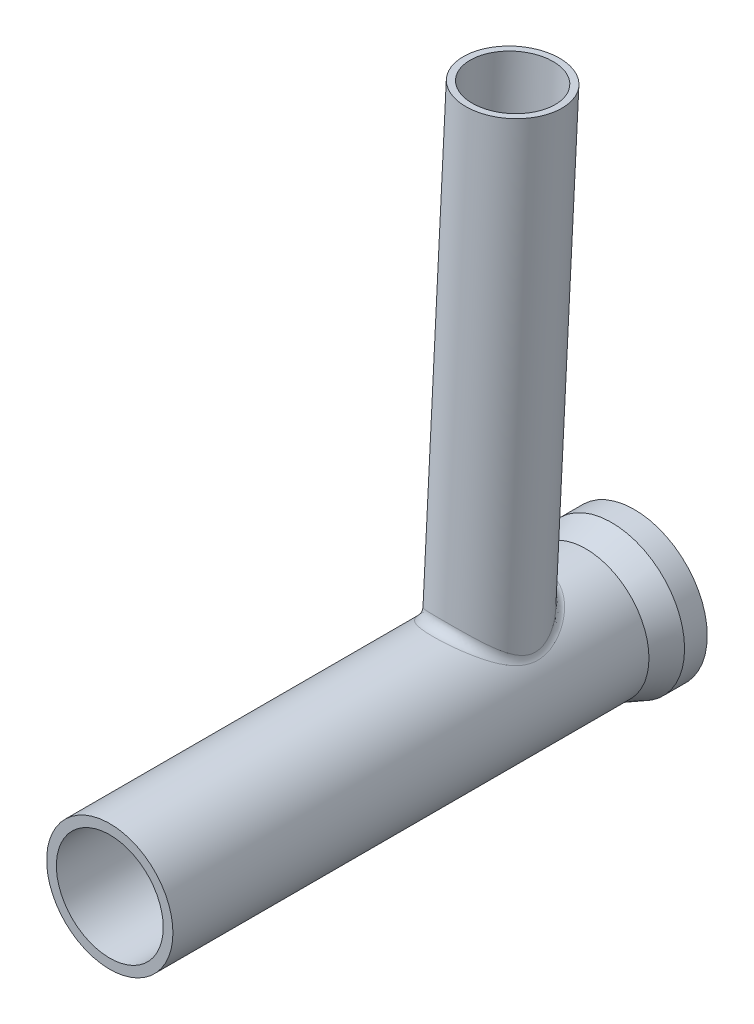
ISO-10303-21;
HEADER;
FILE_DESCRIPTION(('STEP AP214'),'2;1');
FILE_NAME('part.step','',(''),(''),'','','');
FILE_SCHEMA(('AUTOMOTIVE_DESIGN { 1 0 10303 214 1 1 1 1 }'));
ENDSEC;
DATA;
#1=APPLICATION_CONTEXT('core data for automotive mechanical design processes');
#2=APPLICATION_PROTOCOL_DEFINITION('international standard','automotive_design',2000,#1);
#3=PRODUCT_CONTEXT('',#1,'mechanical');
#4=PRODUCT('Part','Part','',(#3));
#5=PRODUCT_RELATED_PRODUCT_CATEGORY('part','',(#4));
#6=PRODUCT_DEFINITION_FORMATION('','',#4);
#7=PRODUCT_DEFINITION_CONTEXT('part definition',#1,'design');
#8=PRODUCT_DEFINITION('design','',#6,#7);
#9=PRODUCT_DEFINITION_SHAPE('','',#8);
#10=(LENGTH_UNIT() NAMED_UNIT(*) SI_UNIT(.MILLI.,.METRE.));
#11=(NAMED_UNIT(*) PLANE_ANGLE_UNIT() SI_UNIT($,.RADIAN.));
#12=(NAMED_UNIT(*) SI_UNIT($,.STERADIAN.) SOLID_ANGLE_UNIT());
#13=UNCERTAINTY_MEASURE_WITH_UNIT(LENGTH_MEASURE(1.E-05),#10,'distance_accuracy_value','');
#14=(GEOMETRIC_REPRESENTATION_CONTEXT(3) GLOBAL_UNCERTAINTY_ASSIGNED_CONTEXT((#13)) GLOBAL_UNIT_ASSIGNED_CONTEXT((#10,
#11,#12)) REPRESENTATION_CONTEXT('',''));
#15=CARTESIAN_POINT('',(0.,0.,0.));
#16=DIRECTION('',(0.,0.,1.));
#17=DIRECTION('',(1.,0.,0.));
#18=AXIS2_PLACEMENT_3D('',#15,#16,#17);
#19=CARTESIAN_POINT('',(19.5,0.,0.));
#20=DIRECTION('',(0.,0.,-1.));
#21=DIRECTION('',(-1.,0.,0.));
#22=AXIS2_PLACEMENT_3D('',#19,#20,#21);
#23=PLANE('',#22);
#24=CARTESIAN_POINT('',(0.,0.,0.));
#25=DIRECTION('',(0.,0.,1.));
#26=DIRECTION('',(1.,0.,0.));
#27=AXIS2_PLACEMENT_3D('',#24,#25,#26);
#28=CIRCLE('',#27,19.5);
#29=CARTESIAN_POINT('',(19.5,0.,0.));
#30=VERTEX_POINT('',#29);
#31=EDGE_CURVE('E80',#30,#30,#28,.T.);
#32=ORIENTED_EDGE('',*,*,#31,.T.);
#33=EDGE_LOOP('',(#32));
#34=FACE_BOUND('',#33,.T.);
#35=CARTESIAN_POINT('',(0.,0.,0.));
#36=DIRECTION('',(0.,0.,1.));
#37=DIRECTION('',(1.,0.,0.));
#38=AXIS2_PLACEMENT_3D('',#35,#36,#37);
#39=CIRCLE('',#38,22.5);
#40=CARTESIAN_POINT('',(22.5,0.,0.));
#41=VERTEX_POINT('',#40);
#42=EDGE_CURVE('E77',#41,#41,#39,.T.);
#43=ORIENTED_EDGE('',*,*,#42,.F.);
#44=EDGE_LOOP('',(#43));
#45=FACE_BOUND('',#44,.T.);
#46=ADVANCED_FACE('F31',(#34,#45),#23,.T.);
#47=CARTESIAN_POINT('',(0.,0.,59.4680309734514));
#48=DIRECTION('',(0.,0.,1.));
#49=DIRECTION('',(1.,0.,0.));
#50=AXIS2_PLACEMENT_3D('',#47,#48,#49);
#51=CYLINDRICAL_SURFACE('',#50,22.5);
#52=ORIENTED_EDGE('',*,*,#42,.T.);
#53=EDGE_LOOP('',(#52));
#54=FACE_BOUND('',#53,.T.);
#55=CARTESIAN_POINT('',(0.,0.,7.));
#56=DIRECTION('',(0.,0.,1.));
#57=DIRECTION('',(1.,0.,0.));
#58=AXIS2_PLACEMENT_3D('',#55,#56,#57);
#59=CIRCLE('',#58,22.5);
#60=CARTESIAN_POINT('',(22.5,0.,7.));
#61=VERTEX_POINT('',#60);
#62=EDGE_CURVE('E157',#61,#61,#59,.T.);
#63=ORIENTED_EDGE('',*,*,#62,.F.);
#64=EDGE_LOOP('',(#63));
#65=FACE_BOUND('',#64,.T.);
#66=ADVANCED_FACE('F110',(#54,#65),#51,.T.);
#67=CARTESIAN_POINT('',(0.,0.,15.));
#68=DIRECTION('',(0.,0.,-1.));
#69=DIRECTION('',(-1.,0.,0.));
#70=AXIS2_PLACEMENT_3D('',#67,#68,#69);
#71=CONICAL_SURFACE('',#70,19.5,0.358770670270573);
#72=ORIENTED_EDGE('',*,*,#62,.T.);
#73=EDGE_LOOP('',(#72));
#74=FACE_BOUND('',#73,.T.);
#75=CARTESIAN_POINT('',(0.,0.,15.));
#76=DIRECTION('',(0.,0.,1.));
#77=DIRECTION('',(1.,0.,0.));
#78=AXIS2_PLACEMENT_3D('',#75,#76,#77);
#79=CIRCLE('',#78,19.5);
#80=CARTESIAN_POINT('',(19.5,0.,15.));
#81=VERTEX_POINT('',#80);
#82=EDGE_CURVE('E154',#81,#81,#79,.T.);
#83=ORIENTED_EDGE('',*,*,#82,.F.);
#84=EDGE_LOOP('',(#83));
#85=FACE_BOUND('',#84,.T.);
#86=ADVANCED_FACE('F64',(#74,#85),#71,.T.);
#87=CARTESIAN_POINT('',(0.,0.,59.4680309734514));
#88=DIRECTION('',(0.,0.,1.));
#89=DIRECTION('',(1.,0.,0.));
#90=AXIS2_PLACEMENT_3D('',#87,#88,#89);
#91=CYLINDRICAL_SURFACE('',#90,19.5);
#92=CARTESIAN_POINT('',(-5.69101481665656,18.6510683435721,28.370456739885));
#93=CARTESIAN_POINT('',(-4.68412072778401,18.9583027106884,30.9825863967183));
#94=CARTESIAN_POINT('',(-5.44086031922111,21.6659989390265,31.1474388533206));
#95=CARTESIAN_POINT('',(-5.38132898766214,18.7455669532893,28.2198886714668));
#96=CARTESIAN_POINT('',(-4.40530359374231,19.0249995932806,30.8856086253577));
#97=CARTESIAN_POINT('',(-5.14478705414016,21.776333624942,31.0216348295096));
#98=CARTESIAN_POINT('',(-5.06554997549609,18.8334803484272,28.0806418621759));
#99=CARTESIAN_POINT('',(-4.12759463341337,19.0847903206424,30.7989689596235));
#100=CARTESIAN_POINT('',(-4.84288843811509,21.8789721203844,30.9052846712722));
#101=CARTESIAN_POINT('',(-4.42312002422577,18.9946195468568,27.8264410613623));
#102=CARTESIAN_POINT('',(-3.57179772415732,19.1919553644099,30.6439469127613));
#103=CARTESIAN_POINT('',(-4.22869716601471,22.0670921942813,30.6928759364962));
#104=CARTESIAN_POINT('',(-4.09647210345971,19.0678493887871,27.7114803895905));
#105=CARTESIAN_POINT('',(-3.29415948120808,19.2391131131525,30.5758808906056));
#106=CARTESIAN_POINT('',(-3.91640739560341,22.1525784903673,30.5968117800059));
#107=CARTESIAN_POINT('',(-3.43417994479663,19.1981835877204,27.5074849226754));
#108=CARTESIAN_POINT('',(-2.73965495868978,19.3213738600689,30.4572436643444));
#109=CARTESIAN_POINT('',(-3.28322698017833,22.3047212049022,30.4263437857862));
#110=CARTESIAN_POINT('',(-3.09854067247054,19.2552966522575,27.4184361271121));
#111=CARTESIAN_POINT('',(-2.46334839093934,19.3562931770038,30.4069382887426));
#112=CARTESIAN_POINT('',(-2.96234108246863,22.371387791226,30.3519282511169));
#113=CARTESIAN_POINT('',(-2.42020559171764,19.3522601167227,27.2675573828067));
#114=CARTESIAN_POINT('',(-1.91172249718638,19.414675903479,30.3228509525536));
#115=CARTESIAN_POINT('',(-2.31382292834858,22.484567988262,30.2258411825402));
#116=CARTESIAN_POINT('',(-2.07750952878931,19.3921098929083,27.2057284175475));
#117=CARTESIAN_POINT('',(-1.63705356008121,19.4379918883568,30.2892814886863));
#118=CARTESIAN_POINT('',(-1.98619042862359,22.5310808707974,30.1741704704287));
#119=CARTESIAN_POINT('',(-1.38614392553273,19.4537792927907,27.1101470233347));
#120=CARTESIAN_POINT('',(-1.08732722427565,19.4737843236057,30.2377476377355));
#121=CARTESIAN_POINT('',(-1.32521452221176,22.6030608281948,30.0942920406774));
#122=CARTESIAN_POINT('',(-1.03745579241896,19.4755251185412,27.0765095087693));
#123=CARTESIAN_POINT('',(-0.812997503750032,19.4861202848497,30.2199855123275));
#124=CARTESIAN_POINT('',(-0.99185334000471,22.6284417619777,30.0661803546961));
#125=CARTESIAN_POINT('',(-0.33821646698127,19.5002048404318,27.0383391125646));
#126=CARTESIAN_POINT('',(-0.264259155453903,19.5001376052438,30.1998021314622));
#127=CARTESIAN_POINT('',(-0.323349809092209,22.6572469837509,30.0342803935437));
#128=CARTESIAN_POINT('',(0.012334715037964,19.5031388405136,27.0338060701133));
#129=CARTESIAN_POINT('',(0.0093945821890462,19.5017804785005,30.1974362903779));
#130=CARTESIAN_POINT('',(0.0117925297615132,22.6606713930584,30.0304919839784));
#131=CARTESIAN_POINT('',(0.712452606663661,19.4901257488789,27.0539268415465));
#132=CARTESIAN_POINT('',(0.557823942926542,19.4944115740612,30.208046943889));
#133=CARTESIAN_POINT('',(0.681136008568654,22.6454830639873,30.047307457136));
#134=CARTESIAN_POINT('',(1.0620193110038,19.4741785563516,27.0785808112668));
#135=CARTESIAN_POINT('',(0.831840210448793,19.4854200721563,30.2209942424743));
#136=CARTESIAN_POINT('',(1.01533714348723,22.626870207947,30.0679114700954));
#137=CARTESIAN_POINT('',(1.75737167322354,19.4237781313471,27.1566298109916));
#138=CARTESIAN_POINT('',(1.38187008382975,19.4564175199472,30.2627521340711));
#139=CARTESIAN_POINT('',(1.68012456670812,22.5680438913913,30.1331383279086));
#140=CARTESIAN_POINT('',(2.10315740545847,19.3893252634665,27.2100242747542));
#141=CARTESIAN_POINT('',(1.65714876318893,19.4364851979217,30.2914493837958));
#142=CARTESIAN_POINT('',(2.01071092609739,22.5278308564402,30.1777606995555));
#143=CARTESIAN_POINT('',(2.76828711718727,19.3052406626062,27.3406785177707));
#144=CARTESIAN_POINT('',(2.19395044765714,19.386482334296,30.3634545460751));
#145=CARTESIAN_POINT('',(2.64660416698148,22.4296851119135,30.2869476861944));
#146=CARTESIAN_POINT('',(3.08799406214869,19.256615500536,27.416358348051));
#147=CARTESIAN_POINT('',(2.45465867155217,19.3571964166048,30.4056318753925));
#148=CARTESIAN_POINT('',(2.95225805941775,22.3729274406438,30.3501920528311));
#149=CARTESIAN_POINT('',(3.71999155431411,19.1445736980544,27.591312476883));
#150=CARTESIAN_POINT('',(2.97794186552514,19.2877386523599,30.505740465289));
#151=CARTESIAN_POINT('',(3.55647544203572,22.2421416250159,30.4963944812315));
#152=CARTESIAN_POINT('',(4.0322792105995,19.0811513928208,27.6905958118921));
#153=CARTESIAN_POINT('',(3.2400144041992,19.2477112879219,30.5634630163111));
#154=CARTESIAN_POINT('',(3.85503616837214,22.1681068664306,30.5793600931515));
#155=CARTESIAN_POINT('',(4.64773119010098,18.9406505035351,27.9114586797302));
#156=CARTESIAN_POINT('',(3.76511718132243,19.156315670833,30.6954746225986));
#157=CARTESIAN_POINT('',(4.44343531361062,22.0040877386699,30.7639169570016));
#158=CARTESIAN_POINT('',(4.95089476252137,18.8635707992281,28.0330400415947));
#159=CARTESIAN_POINT('',(4.02772604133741,19.1051236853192,30.7695073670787));
#160=CARTESIAN_POINT('',(4.73327301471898,21.9141020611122,30.8655097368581));
#161=CARTESIAN_POINT('',(5.54682469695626,18.6970187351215,28.2970967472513));
#162=CARTESIAN_POINT('',(4.55260978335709,18.9911762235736,30.9347419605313));
#163=CARTESIAN_POINT('',(5.30300822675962,21.7196510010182,31.0861453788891));
#164=CARTESIAN_POINT('',(5.83958906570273,18.6075440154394,28.4395760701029));
#165=CARTESIAN_POINT('',(4.8145585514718,18.9286120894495,31.025662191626));
#166=CARTESIAN_POINT('',(5.58290383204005,21.6151828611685,31.2051915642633));
#167=CARTESIAN_POINT('',(6.51001478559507,18.3856652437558,28.7950644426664));
#168=CARTESIAN_POINT('',(5.42295323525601,18.7693524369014,31.2580090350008));
#169=CARTESIAN_POINT('',(6.2238602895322,21.3561040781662,31.5021997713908));
#170=CARTESIAN_POINT('',(6.88322159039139,18.2489272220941,29.0157023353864));
#171=CARTESIAN_POINT('',(5.76938177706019,18.6682450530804,31.4061337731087));
#172=CARTESIAN_POINT('',(6.5806623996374,21.1964266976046,31.686531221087));
#173=CARTESIAN_POINT('',(7.60766863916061,17.9590014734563,29.4883964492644));
#174=CARTESIAN_POINT('',(6.45489555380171,18.4463790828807,31.7337592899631));
#175=CARTESIAN_POINT('',(7.27326562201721,20.8578189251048,32.0814112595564));
#176=CARTESIAN_POINT('',(7.95890236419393,17.8058089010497,29.7404619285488));
#177=CARTESIAN_POINT('',(6.79374300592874,18.3260485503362,31.9125903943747));
#178=CARTESIAN_POINT('',(7.60906050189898,20.6788828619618,32.2919675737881));
#179=CARTESIAN_POINT('',(8.6388006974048,17.4860634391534,30.2733263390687));
#180=CARTESIAN_POINT('',(7.46042852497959,18.0675183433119,32.3009906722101));
#181=CARTESIAN_POINT('',(8.25907319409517,20.3053447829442,32.7370395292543));
#182=CARTESIAN_POINT('',(8.9674372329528,17.3194944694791,30.5541599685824));
#183=CARTESIAN_POINT('',(7.78828310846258,17.9296533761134,32.5099970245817));
#184=CARTESIAN_POINT('',(8.57326416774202,20.1107239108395,32.971584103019));
#185=CARTESIAN_POINT('',(9.60114630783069,16.9763902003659,31.1417424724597));
#186=CARTESIAN_POINT('',(8.42902935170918,17.6387947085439,32.9572260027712));
#187=CARTESIAN_POINT('',(9.17911789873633,19.7097557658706,33.462261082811));
#188=CARTESIAN_POINT('',(9.90622043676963,16.799855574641,31.4484895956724));
#189=CARTESIAN_POINT('',(8.74215040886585,17.4860590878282,33.194953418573));
#190=CARTESIAN_POINT('',(9.47078217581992,19.5034092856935,33.7183920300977));
#191=CARTESIAN_POINT('',(10.496982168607,16.437312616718,32.090632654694));
#192=CARTESIAN_POINT('',(9.35500886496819,17.1662528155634,33.7017803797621));
#193=CARTESIAN_POINT('',(10.0355763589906,19.0795335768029,34.2545029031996));
#194=CARTESIAN_POINT('',(10.7823142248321,16.2512024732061,32.426386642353));
#195=CARTESIAN_POINT('',(9.65494134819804,16.9991137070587,33.9709748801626));
#196=CARTESIAN_POINT('',(10.3083663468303,18.8618837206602,34.5347807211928));
#197=CARTESIAN_POINT('',(11.3284316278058,15.8753429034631,33.1209745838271));
#198=CARTESIAN_POINT('',(10.233979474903,16.656145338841,34.5363444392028));
#199=CARTESIAN_POINT('',(10.8304785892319,18.4221800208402,35.1145082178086));
#200=CARTESIAN_POINT('',(11.5892153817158,15.6855932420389,33.4798100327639));
#201=CARTESIAN_POINT('',(10.5135753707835,16.4803473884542,34.8322742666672));
#202=CARTESIAN_POINT('',(11.0797993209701,18.200125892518,35.4139591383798));
#203=CARTESIAN_POINT('',(12.0861374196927,15.3059809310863,34.2196035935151));
#204=CARTESIAN_POINT('',(11.0499192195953,16.1241465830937,35.4498214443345));
#205=CARTESIAN_POINT('',(11.5548786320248,17.7556891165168,36.031202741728));
#206=CARTESIAN_POINT('',(12.3222697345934,15.116118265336,34.6005670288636));
#207=CARTESIAN_POINT('',(11.3072105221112,15.9436618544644,35.7713310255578));
#208=CARTESIAN_POINT('',(11.7806315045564,17.5333064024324,36.3489998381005));
#209=CARTESIAN_POINT('',(12.7694831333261,14.7402702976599,35.3839805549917));
#210=CARTESIAN_POINT('',(11.7969868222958,15.5827599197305,36.4389072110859));
#211=CARTESIAN_POINT('',(12.2081871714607,17.0928202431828,37.0023672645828));
#212=CARTESIAN_POINT('',(12.980566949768,14.5542845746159,35.7864282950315));
#213=CARTESIAN_POINT('',(12.0300462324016,15.4021610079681,36.7849825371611));
#214=CARTESIAN_POINT('',(12.4099925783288,16.8747163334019,37.3379356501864));
#215=CARTESIAN_POINT('',(13.3532119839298,14.2125909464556,36.5630202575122));
#216=CARTESIAN_POINT('',(12.4433468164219,15.067503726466,37.4583649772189));
#217=CARTESIAN_POINT('',(12.7662576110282,16.4736816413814,37.9852946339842));
#218=CARTESIAN_POINT('',(13.5176760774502,14.0559306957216,36.9347523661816));
#219=CARTESIAN_POINT('',(12.626726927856,14.9128773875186,37.7826023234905));
#220=CARTESIAN_POINT('',(12.9234925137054,16.2896741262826,38.2950953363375));
#221=CARTESIAN_POINT('',(13.8259884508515,13.7527731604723,37.6948697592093));
#222=CARTESIAN_POINT('',(12.9714275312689,14.6119676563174,38.4491365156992));
#223=CARTESIAN_POINT('',(13.2182526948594,15.9332308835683,38.9283978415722));
#224=CARTESIAN_POINT('',(13.9698352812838,13.606276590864,38.0832562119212));
#225=CARTESIAN_POINT('',(13.1331289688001,14.4654528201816,38.7916075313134));
#226=CARTESIAN_POINT('',(13.3557765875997,15.7607959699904,39.251900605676));
#227=CARTESIAN_POINT('',(14.2355289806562,13.3280403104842,38.8759311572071));
#228=CARTESIAN_POINT('',(13.4324193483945,14.1859250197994,39.4934610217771));
#229=CARTESIAN_POINT('',(13.6097914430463,15.4328028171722,39.9119370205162));
#230=CARTESIAN_POINT('',(14.3574133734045,13.1962755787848,39.2801910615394));
#231=CARTESIAN_POINT('',(13.5704115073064,14.0526241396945,39.8530667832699));
#232=CARTESIAN_POINT('',(13.7263182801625,15.277215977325,40.2484472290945));
#233=CARTESIAN_POINT('',(14.577924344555,12.9522660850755,40.1048798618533));
#234=CARTESIAN_POINT('',(13.8204762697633,13.8048683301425,40.5888834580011));
#235=CARTESIAN_POINT('',(13.9371364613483,14.9884098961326,40.9346706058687));
#236=CARTESIAN_POINT('',(14.6765512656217,12.8400210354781,40.525308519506));
#237=CARTESIAN_POINT('',(13.9328860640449,13.6901262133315,40.9654493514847));
#238=CARTESIAN_POINT('',(14.0314281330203,14.855190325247,41.2843835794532));
#239=CARTESIAN_POINT('',(14.8255649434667,12.6673575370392,41.2665843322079));
#240=CARTESIAN_POINT('',(14.1031378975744,13.5129062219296,41.6311772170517));
#241=CARTESIAN_POINT('',(14.1738917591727,14.6494152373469,41.9007165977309));
#242=CARTESIAN_POINT('',(14.8818013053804,12.6011023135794,41.5840618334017));
#243=CARTESIAN_POINT('',(14.167584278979,13.4446146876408,41.9167047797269));
#244=CARTESIAN_POINT('',(14.2276561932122,14.5701583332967,42.164603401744));
#245=CARTESIAN_POINT('',(14.9797989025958,12.4844479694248,42.2256679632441));
#246=CARTESIAN_POINT('',(14.280136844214,13.3239824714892,42.4943246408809));
#247=CARTESIAN_POINT('',(14.3213462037,14.4298718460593,42.6977271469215));
#248=CARTESIAN_POINT('',(15.0215687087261,12.4340394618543,42.5497925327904));
#249=CARTESIAN_POINT('',(14.3283508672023,13.2715321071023,42.7866290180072));
#250=CARTESIAN_POINT('',(14.3612799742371,14.3688314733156,42.9669608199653));
#251=CARTESIAN_POINT('',(15.0897796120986,12.3511718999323,43.2027570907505));
#252=CARTESIAN_POINT('',(14.4074250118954,13.1848399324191,43.3757862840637));
#253=CARTESIAN_POINT('',(14.4264925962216,14.2674096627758,43.509151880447));
#254=CARTESIAN_POINT('',(15.1162431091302,12.3186866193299,43.531589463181));
#255=CARTESIAN_POINT('',(14.4383850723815,13.1504916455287,43.6728776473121));
#256=CARTESIAN_POINT('',(14.4517928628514,14.2269980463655,43.7821032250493));
#257=CARTESIAN_POINT('',(15.1532444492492,12.2731437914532,44.1922586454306));
#258=CARTESIAN_POINT('',(14.4822660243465,13.1015852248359,44.2697737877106));
#259=CARTESIAN_POINT('',(14.4871677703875,14.1685539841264,44.3302958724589));
#260=CARTESIAN_POINT('',(15.1637825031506,12.2600859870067,44.5240954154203));
#261=CARTESIAN_POINT('',(14.4952329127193,13.0869762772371,44.5698490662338));
#262=CARTESIAN_POINT('',(14.4972426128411,14.1505212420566,44.6055371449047));
#263=CARTESIAN_POINT('',(15.1685294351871,12.254212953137,45.1895952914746));
#264=CARTESIAN_POINT('',(14.5027006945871,13.0783907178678,45.1713584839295));
#265=CARTESIAN_POINT('',(14.5017808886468,14.1377852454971,45.1573245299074));
#266=CARTESIAN_POINT('',(15.1626684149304,12.2614843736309,45.5232601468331));
#267=CARTESIAN_POINT('',(14.4971351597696,13.0844882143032,45.4730793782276));
#268=CARTESIAN_POINT('',(14.496177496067,14.1431819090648,45.4338711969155));
#269=CARTESIAN_POINT('',(15.1344207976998,12.2963328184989,46.1882210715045));
#270=CARTESIAN_POINT('',(14.4673741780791,13.1173378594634,46.0738062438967));
#271=CARTESIAN_POINT('',(14.4691715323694,14.1774150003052,45.9847907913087));
#272=CARTESIAN_POINT('',(15.1120343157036,12.3239097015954,46.5195171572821));
#273=CARTESIAN_POINT('',(14.4431561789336,13.1441149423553,46.3730957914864));
#274=CARTESIAN_POINT('',(14.4477690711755,14.2062512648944,46.2591637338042));
#275=CARTESIAN_POINT('',(15.0510229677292,12.3983469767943,47.177603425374));
#276=CARTESIAN_POINT('',(14.3765124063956,13.2171736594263,46.966778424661));
#277=CARTESIAN_POINT('',(14.389439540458,14.2862039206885,46.8039746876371));
#278=CARTESIAN_POINT('',(15.0123772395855,12.4452321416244,47.5043872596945));
#279=CARTESIAN_POINT('',(14.334007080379,13.2635412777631,47.2614307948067));
#280=CARTESIAN_POINT('',(14.3524925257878,14.3373489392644,47.0744071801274));
#281=CARTESIAN_POINT('',(14.9194628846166,12.5564667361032,48.1509478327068));
#282=CARTESIAN_POINT('',(14.231608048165,13.3737773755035,47.8433679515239));
#283=CARTESIAN_POINT('',(14.2636623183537,14.4598433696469,47.6092824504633));
#284=CARTESIAN_POINT('',(14.8651919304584,12.6208187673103,48.4707235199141));
#285=CARTESIAN_POINT('',(14.1716268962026,13.437737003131,48.1308890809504));
#286=CARTESIAN_POINT('',(14.2117769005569,14.5311957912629,47.87372432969));
#287=CARTESIAN_POINT('',(14.7250673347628,12.7842439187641,49.1873039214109));
#288=CARTESIAN_POINT('',(14.0167392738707,13.6001329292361,48.7740380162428));
#289=CARTESIAN_POINT('',(14.0778116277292,14.7132544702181,48.4661093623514));
#290=CARTESIAN_POINT('',(14.6346404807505,12.8880003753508,49.5814980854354));
#291=CARTESIAN_POINT('',(13.9166582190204,13.7033229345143,49.127028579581));
#292=CARTESIAN_POINT('',(13.9913595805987,14.8293854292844,48.7918398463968));
#293=CARTESIAN_POINT('',(14.431426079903,13.1151489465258,50.354414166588));
#294=CARTESIAN_POINT('',(13.6922840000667,13.9285180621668,49.8166961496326));
#295=CARTESIAN_POINT('',(13.7970776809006,15.0844318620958,49.4302706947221));
#296=CARTESIAN_POINT('',(14.3186280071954,13.2385502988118,50.7331286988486));
#297=CARTESIAN_POINT('',(13.5677182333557,14.0507650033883,50.1536853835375));
#298=CARTESIAN_POINT('',(13.6892377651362,15.223358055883,49.742964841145));
#299=CARTESIAN_POINT('',(14.0719219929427,13.500497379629,51.4750101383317));
#300=CARTESIAN_POINT('',(13.2961981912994,14.3091100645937,50.8110629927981));
#301=CARTESIAN_POINT('',(13.4533759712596,15.5188158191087,50.3553069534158));
#302=CARTESIAN_POINT('',(13.9379708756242,13.6390739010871,51.8381432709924));
#303=CARTESIAN_POINT('',(13.1489119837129,14.4454599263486,51.1316460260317));
#304=CARTESIAN_POINT('',(13.3253128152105,15.6753832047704,50.6549266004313));
#305=CARTESIAN_POINT('',(13.6503334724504,13.9269461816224,52.5478830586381));
#306=CARTESIAN_POINT('',(12.8339656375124,14.727158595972,51.7551509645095));
#307=CARTESIAN_POINT('',(13.0503188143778,16.0010285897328,51.2403539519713));
#308=CARTESIAN_POINT('',(13.4966464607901,14.0762423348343,52.8944891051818));
#309=CARTESIAN_POINT('',(12.6660032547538,14.8727074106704,52.0582290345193));
#310=CARTESIAN_POINT('',(12.9033872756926,16.1701070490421,51.5261611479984));
#311=CARTESIAN_POINT('',(13.112895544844,14.4358326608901,53.6906820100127));
#312=CARTESIAN_POINT('',(12.2480516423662,15.221514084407,52.7514935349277));
#313=CARTESIAN_POINT('',(12.5365045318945,16.5776905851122,52.182520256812));
#314=CARTESIAN_POINT('',(12.8750067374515,14.6490757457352,54.1334955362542));
#315=CARTESIAN_POINT('',(11.990200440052,15.4266759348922,53.1335082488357));
#316=CARTESIAN_POINT('',(12.3090723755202,16.8196573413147,52.5474263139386));
#317=CARTESIAN_POINT('',(12.3662382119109,15.0810361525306,54.9894250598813));
#318=CARTESIAN_POINT('',(11.4434840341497,15.8377310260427,53.8650452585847));
#319=CARTESIAN_POINT('',(11.8226673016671,17.31017039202,53.2525613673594));
#320=CARTESIAN_POINT('',(12.0953481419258,15.2997551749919,55.4025316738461));
#321=CARTESIAN_POINT('',(11.1538678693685,16.0438825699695,54.2145689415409));
#322=CARTESIAN_POINT('',(11.563684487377,17.5587187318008,53.5927825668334));
#323=CARTESIAN_POINT('',(11.5212813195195,15.7365914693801,56.199042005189));
#324=CARTESIAN_POINT('',(10.546356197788,16.4503209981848,54.8810047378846));
#325=CARTESIAN_POINT('',(11.0148513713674,18.0553875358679,54.2486062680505));
#326=CARTESIAN_POINT('',(11.2180730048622,15.9547079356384,56.5824160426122));
#327=CARTESIAN_POINT('',(10.2277494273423,16.65069621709,55.1977021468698));
#328=CARTESIAN_POINT('',(10.7249708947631,18.3035073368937,54.5641841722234));
#329=CARTESIAN_POINT('',(10.5803447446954,16.3845713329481,57.3178866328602));
#330=CARTESIAN_POINT('',(9.56564943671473,17.0396300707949,55.7972568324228));
#331=CARTESIAN_POINT('',(10.1152746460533,18.7926811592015,55.1694755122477));
#332=CARTESIAN_POINT('',(10.2458295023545,16.5963192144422,57.6699878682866));
#333=CARTESIAN_POINT('',(9.22158292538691,17.2281139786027,56.0797557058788));
#334=CARTESIAN_POINT('',(9.79546337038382,19.0337362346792,55.4591928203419));
#335=CARTESIAN_POINT('',(9.54374360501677,17.0098231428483,58.3434481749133));
#336=CARTESIAN_POINT('',(8.50944664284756,17.5897697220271,56.611807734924));
#337=CARTESIAN_POINT('',(9.12423839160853,19.5045981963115,56.0132442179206));
#338=CARTESIAN_POINT('',(9.17596024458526,17.2114999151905,58.6645776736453));
#339=CARTESIAN_POINT('',(8.14086544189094,17.7625499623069,56.8605380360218));
#340=CARTESIAN_POINT('',(8.77262133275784,19.7343157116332,56.2773888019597));
#341=CARTESIAN_POINT('',(8.41028082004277,17.5983280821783,59.2706926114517));
#342=CARTESIAN_POINT('',(7.38579756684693,18.0873265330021,57.3217040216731));
#343=CARTESIAN_POINT('',(8.04059814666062,20.1750157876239,56.7758839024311));
#344=CARTESIAN_POINT('',(8.01237769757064,17.7834755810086,59.5556695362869));
#345=CARTESIAN_POINT('',(6.99917592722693,18.2388947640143,57.5334160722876));
#346=CARTESIAN_POINT('',(7.66018527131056,20.3859939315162,57.0102274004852));
#347=CARTESIAN_POINT('',(7.1899637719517,18.1315465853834,60.0848826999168));
#348=CARTESIAN_POINT('',(6.2142348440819,18.5175822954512,57.9189164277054));
#349=CARTESIAN_POINT('',(6.87392140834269,20.7826842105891,57.4453684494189));
#350=CARTESIAN_POINT('',(6.76557180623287,18.2945602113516,60.3292851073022));
#351=CARTESIAN_POINT('',(5.81616796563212,18.6442665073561,58.0920533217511));
#352=CARTESIAN_POINT('',(6.46818403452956,20.9684987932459,57.6463028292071));
#353=CARTESIAN_POINT('',(5.89154768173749,18.5944263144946,60.7747981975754));
#354=CARTESIAN_POINT('',(5.01156834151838,18.8720449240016,58.4013415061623));
#355=CARTESIAN_POINT('',(5.63257855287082,21.3103440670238,58.0125514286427));
#356=CARTESIAN_POINT('',(5.4419399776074,18.7313035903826,60.9759499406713));
#357=CARTESIAN_POINT('',(4.60567261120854,18.9725609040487,58.5366758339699));
#358=CARTESIAN_POINT('',(5.20273382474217,21.4664029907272,58.1778994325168));
#359=CARTESIAN_POINT('',(4.69849481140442,18.9277588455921,61.2628002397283));
#360=CARTESIAN_POINT('',(3.94804128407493,19.1134474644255,58.725609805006));
#361=CARTESIAN_POINT('',(4.49196756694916,21.6904056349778,58.4136791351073));
#362=CARTESIAN_POINT('',(4.41131871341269,18.9968099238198,61.3631346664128));
#363=CARTESIAN_POINT('',(3.69642562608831,19.1621120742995,58.7906626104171));
#364=CARTESIAN_POINT('',(4.21741459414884,21.7691435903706,58.4961466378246));
#365=CARTESIAN_POINT('',(3.82973168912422,19.1225432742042,61.5452334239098));
#366=CARTESIAN_POINT('',(3.19203596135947,19.2495835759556,58.9073710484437));
#367=CARTESIAN_POINT('',(3.66139183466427,21.9125208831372,58.6458141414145));
#368=CARTESIAN_POINT('',(3.53531735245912,19.1792195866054,61.626988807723));
#369=CARTESIAN_POINT('',(2.93956639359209,19.2882626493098,58.9588543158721));
#370=CARTESIAN_POINT('',(3.37991878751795,21.9771534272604,58.7130067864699));
#371=CARTESIAN_POINT('',(2.89686528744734,19.2867262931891,61.7816947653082));
#372=CARTESIAN_POINT('',(2.3966473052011,19.3608853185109,59.0554026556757));
#373=CARTESIAN_POINT('',(2.76953054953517,22.0997552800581,58.8401529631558));
#374=CARTESIAN_POINT('',(2.55190897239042,19.3354640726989,61.8515719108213));
#375=CARTESIAN_POINT('',(2.10684580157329,19.3931105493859,59.0981628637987));
#376=CARTESIAN_POINT('',(2.43973714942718,22.1553387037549,58.897580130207));
#377=CARTESIAN_POINT('',(1.85653205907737,19.4145765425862,61.9648135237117));
#378=CARTESIAN_POINT('',(1.52679969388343,19.4450432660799,59.1670257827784));
#379=CARTESIAN_POINT('',(1.7749262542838,22.2455648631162,58.9906442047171));
#380=CARTESIAN_POINT('',(1.50610961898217,19.4449448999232,62.008168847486));
#381=CARTESIAN_POINT('',(1.23715865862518,19.4646344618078,59.1929740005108));
#382=CARTESIAN_POINT('',(1.4399069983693,22.2802003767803,59.0262735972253));
#383=CARTESIAN_POINT('',(0.802041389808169,19.4866931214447,62.0677349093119));
#384=CARTESIAN_POINT('',(0.657197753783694,19.4915271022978,59.2285849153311));
#385=CARTESIAN_POINT('',(0.766786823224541,22.3278150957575,59.0752247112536));
#386=CARTESIAN_POINT('',(0.448392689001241,19.4980536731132,62.0839180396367));
#387=CARTESIAN_POINT('',(0.367525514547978,19.4987555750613,59.2381509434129));
#388=CARTESIAN_POINT('',(0.428683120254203,22.3407722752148,59.0885237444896));
#389=CARTESIAN_POINT('',(-0.259109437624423,19.5014869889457,62.0888108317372));
#390=CARTESIAN_POINT('',(-0.212429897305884,19.5009509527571,59.24105668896));
#391=CARTESIAN_POINT('',(-0.247720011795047,22.3446880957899,59.0925445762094));
#392=CARTESIAN_POINT('',(-0.612962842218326,19.4935614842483,62.0775229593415));
#393=CARTESIAN_POINT('',(-0.502049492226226,19.4959139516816,59.2343912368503));
#394=CARTESIAN_POINT('',(-0.586019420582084,22.3356487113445,59.0832684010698));
#395=CARTESIAN_POINT('',(-1.31786303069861,19.4586131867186,62.0276769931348));
#396=CARTESIAN_POINT('',(-1.08184676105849,19.4734512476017,59.2046506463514));
#397=CARTESIAN_POINT('',(-1.25993498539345,22.2957892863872,59.0423053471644));
#398=CARTESIAN_POINT('',(-1.668912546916,19.431612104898,61.9891499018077));
#399=CARTESIAN_POINT('',(-1.37137228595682,19.4560902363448,59.1816611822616));
#400=CARTESIAN_POINT('',(-1.59555375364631,22.2649940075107,59.0106439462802));
#401=CARTESIAN_POINT('',(-2.36609747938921,19.3590916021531,61.8854194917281));
#402=CARTESIAN_POINT('',(-1.95132339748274,19.4086811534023,59.1188169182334));
#403=CARTESIAN_POINT('',(-2.26209319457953,22.1822851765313,58.9253969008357));
#404=CARTESIAN_POINT('',(-2.71223276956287,19.3135717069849,61.8202154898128));
#405=CARTESIAN_POINT('',(-2.24113670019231,19.3787358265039,59.0790985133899));
#406=CARTESIAN_POINT('',(-2.59301374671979,22.1303710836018,58.8718106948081));
#407=CARTESIAN_POINT('',(-3.39721954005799,19.204925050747,61.6640425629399));
#408=CARTESIAN_POINT('',(-2.82120902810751,19.3057845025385,58.9821688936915));
#409=CARTESIAN_POINT('',(-3.24789120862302,22.0064676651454,58.7434601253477));
#410=CARTESIAN_POINT('',(-3.73607214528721,19.1418010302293,61.5730776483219));
#411=CARTESIAN_POINT('',(-3.11091836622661,19.2629295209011,58.9251592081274));
#412=CARTESIAN_POINT('',(-3.57184919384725,21.9344814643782,58.668699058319));
#413=CARTESIAN_POINT('',(-4.40466232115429,18.9991014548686,61.3664935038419));
#414=CARTESIAN_POINT('',(-3.69006246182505,19.1638313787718,58.7929723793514));
#415=CARTESIAN_POINT('',(-4.21105079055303,21.7717563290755,58.4989075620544));
#416=CARTESIAN_POINT('',(-4.73439626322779,18.9195194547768,61.2508646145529));
#417=CARTESIAN_POINT('',(-3.9790322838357,19.107767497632,58.7180366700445));
#418=CARTESIAN_POINT('',(-4.52629093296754,21.681010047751,58.4038691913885));
#419=CARTESIAN_POINT('',(-5.38808721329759,18.7439291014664,60.9942622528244));
#420=CARTESIAN_POINT('',(-4.55982955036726,18.9811599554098,58.5481505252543));
#421=CARTESIAN_POINT('',(-5.15124821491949,21.4807999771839,58.1929505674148));
#422=CARTESIAN_POINT('',(-5.7118686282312,18.6476793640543,60.8529145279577));
#423=CARTESIAN_POINT('',(-4.85129145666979,18.9106056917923,58.4531820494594));
#424=CARTESIAN_POINT('',(-5.46079747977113,21.3710611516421,58.0767625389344));
#425=CARTESIAN_POINT('',(-6.34681533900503,18.4412427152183,60.5475585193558));
#426=CARTESIAN_POINT('',(-5.43087107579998,18.7557392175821,58.24359145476));
#427=CARTESIAN_POINT('',(-6.06783444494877,21.1357127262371,57.8257440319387));
#428=CARTESIAN_POINT('',(-6.65797635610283,18.3310511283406,60.3835426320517));
#429=CARTESIAN_POINT('',(-5.7187179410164,18.671646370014,58.1292765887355));
#430=CARTESIAN_POINT('',(-6.3653180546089,21.0100978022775,57.6909072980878));
#431=CARTESIAN_POINT('',(-7.26638788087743,18.0984984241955,60.0343735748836));
#432=CARTESIAN_POINT('',(-6.28902036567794,18.4902843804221,57.8809737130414));
#433=CARTESIAN_POINT('',(-6.94698621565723,20.7450221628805,57.4038359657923));
#434=CARTESIAN_POINT('',(-7.56364220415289,17.9761406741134,59.8492262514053));
#435=CARTESIAN_POINT('',(-6.57131886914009,18.3932342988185,57.7473041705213));
#436=CARTESIAN_POINT('',(-7.23117441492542,20.6055652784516,57.251606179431));
#437=CARTESIAN_POINT('',(-8.14354389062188,17.7209783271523,59.4590932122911));
#438=CARTESIAN_POINT('',(-7.12873170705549,18.1868235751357,57.4604254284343));
#439=CARTESIAN_POINT('',(-7.78558591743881,20.3147808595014,56.9308077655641));
#440=CARTESIAN_POINT('',(-8.4261893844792,17.5881723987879,59.2541049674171));
#441=CARTESIAN_POINT('',(-7.40379280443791,18.0776531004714,57.3075081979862));
#442=CARTESIAN_POINT('',(-8.05580743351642,20.1634518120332,56.7622370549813));
#443=CARTESIAN_POINT('',(-9.01923382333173,17.2924741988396,58.7920258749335));
#444=CARTESIAN_POINT('',(-7.98664782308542,17.8304982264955,56.9574054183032));
#445=CARTESIAN_POINT('',(-8.62278398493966,19.8265618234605,56.3822114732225));
#446=CARTESIAN_POINT('',(-9.3270715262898,17.1281227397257,58.5317980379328));
#447=CARTESIAN_POINT('',(-8.29351971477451,17.6906408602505,56.757043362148));
#448=CARTESIAN_POINT('',(-8.91709036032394,19.6393461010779,56.1681709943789));
#449=CARTESIAN_POINT('',(-9.92168727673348,16.7906815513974,57.9880984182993));
#450=CARTESIAN_POINT('',(-8.89257481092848,17.3983923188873,56.3313761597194));
#451=CARTESIAN_POINT('',(-9.48556915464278,19.2550450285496,55.720910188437));
#452=CARTESIAN_POINT('',(-10.2084679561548,16.6175929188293,57.7046295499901));
#453=CARTESIAN_POINT('',(-9.18495209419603,17.2461721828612,56.1064103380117));
#454=CARTESIAN_POINT('',(-9.75974408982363,19.0579609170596,55.4876922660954));
#455=CARTESIAN_POINT('',(-10.7612508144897,16.2650909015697,57.1149050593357));
#456=CARTESIAN_POINT('',(-9.7534896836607,16.9315678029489,55.6317250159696));
#457=CARTESIAN_POINT('',(-10.2882288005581,18.6567024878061,55.002430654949));
#458=CARTESIAN_POINT('',(-11.0272002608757,16.0856630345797,56.8085952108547));
#459=CARTESIAN_POINT('',(-10.0299111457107,16.7692420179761,55.3821936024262));
#460=CARTESIAN_POINT('',(-10.5424881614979,18.4525119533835,54.7503421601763));
#461=CARTESIAN_POINT('',(-11.5370688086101,15.7239858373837,56.1747401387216));
#462=CARTESIAN_POINT('',(-10.5636680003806,16.4380238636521,54.8596399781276));
#463=CARTESIAN_POINT('',(-11.0299449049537,18.0410671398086,54.2285893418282));
#464=CARTESIAN_POINT('',(-11.780993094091,15.5417371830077,55.8471999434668));
#465=CARTESIAN_POINT('',(-10.8213710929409,16.2691359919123,54.5867908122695));
#466=CARTESIAN_POINT('',(-11.2631472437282,17.8338135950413,53.9589291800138));
#467=CARTESIAN_POINT('',(-12.2894399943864,15.1440444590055,55.1088558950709));
#468=CARTESIAN_POINT('',(-11.3610223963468,15.8973230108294,53.9662594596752));
#469=CARTESIAN_POINT('',(-11.7492448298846,17.3817680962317,53.3509230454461));
#470=CARTESIAN_POINT('',(-12.5494556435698,14.9286816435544,54.6938416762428));
#471=CARTESIAN_POINT('',(-11.6399828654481,15.6932695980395,53.6133797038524));
#472=CARTESIAN_POINT('',(-11.9978312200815,17.1371075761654,53.0090856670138));
#473=CARTESIAN_POINT('',(-13.0371428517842,14.5047343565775,53.8345429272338));
#474=CARTESIAN_POINT('',(-12.1656303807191,15.2880396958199,52.875825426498));
#475=CARTESIAN_POINT('',(-12.464081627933,16.6558662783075,52.301074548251));
#476=CARTESIAN_POINT('',(-13.2648014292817,14.2961526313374,53.3902467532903));
#477=CARTESIAN_POINT('',(-12.413029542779,15.086578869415,52.4910787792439));
#478=CARTESIAN_POINT('',(-12.6817332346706,16.419288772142,51.9348911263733));
#479=CARTESIAN_POINT('',(-13.6854965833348,13.8939420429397,52.4734508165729));
#480=CARTESIAN_POINT('',(-12.8715450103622,14.6957203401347,51.6913718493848));
#481=CARTESIAN_POINT('',(-13.083936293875,15.9636316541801,51.1789877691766));
#482=CARTESIAN_POINT('',(-13.8786212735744,13.7002758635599,52.0010270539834));
#483=CARTESIAN_POINT('',(-13.0834732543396,14.5058831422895,51.2762474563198));
#484=CARTESIAN_POINT('',(-13.2685719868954,15.7445083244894,50.7893312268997));
#485=CARTESIAN_POINT('',(-14.228392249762,13.336657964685,51.0270772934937));
#486=CARTESIAN_POINT('',(-13.4677712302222,14.1482030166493,50.4158008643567));
#487=CARTESIAN_POINT('',(-13.6029684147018,15.3338723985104,49.9856460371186));
#488=CARTESIAN_POINT('',(-14.3850720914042,13.1666844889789,50.5255786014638));
#489=CARTESIAN_POINT('',(-13.6408716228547,13.9798281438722,49.9700293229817));
#490=CARTESIAN_POINT('',(-13.7527612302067,15.1423344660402,49.5716402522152));
#491=CARTESIAN_POINT('',(-14.6024687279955,12.9241081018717,49.7065682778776));
#492=CARTESIAN_POINT('',(-13.8812409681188,13.7390226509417,49.2383504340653));
#493=CARTESIAN_POINT('',(-13.9606019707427,14.869908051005,48.8951548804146));
#494=CARTESIAN_POINT('',(-14.6761746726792,12.8401788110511,49.3980482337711));
#495=CARTESIAN_POINT('',(-13.9627520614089,13.6556329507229,48.9623665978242));
#496=CARTESIAN_POINT('',(-14.0310680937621,14.7758762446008,48.6402467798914));
#497=CARTESIAN_POINT('',(-14.8089638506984,12.6867991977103,48.7721966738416));
#498=CARTESIAN_POINT('',(-14.1094875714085,13.503295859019,48.4015627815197));
#499=CARTESIAN_POINT('',(-14.158020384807,14.6045902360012,48.1229758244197));
#500=CARTESIAN_POINT('',(-14.8680524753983,12.6173435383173,48.454868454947));
#501=CARTESIAN_POINT('',(-14.174831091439,13.4342341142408,48.1165555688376));
#502=CARTESIAN_POINT('',(-14.2145117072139,14.527329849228,47.8606157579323));
#503=CARTESIAN_POINT('',(-14.9707251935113,12.4953494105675,47.8132759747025));
#504=CARTESIAN_POINT('',(-14.2881246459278,13.3131861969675,47.539623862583));
#505=CARTESIAN_POINT('',(-14.3126713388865,14.3923818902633,47.3299704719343));
#506=CARTESIAN_POINT('',(-15.0143401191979,12.4427773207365,47.4890268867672));
#507=CARTESIAN_POINT('',(-14.33620133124,13.2610715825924,47.2474898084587));
#508=CARTESIAN_POINT('',(-14.3543691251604,14.3346554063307,47.0616981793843));
#509=CARTESIAN_POINT('',(-15.0855511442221,12.3563465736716,46.8348710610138));
#510=CARTESIAN_POINT('',(-14.4142990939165,13.1758648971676,46.6577292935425));
#511=CARTESIAN_POINT('',(-14.4224499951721,14.2408354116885,46.5202697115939));
#512=CARTESIAN_POINT('',(-15.1131472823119,12.3224878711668,46.5049643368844));
#513=CARTESIAN_POINT('',(-14.4443858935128,13.1427022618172,46.3598455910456));
#514=CARTESIAN_POINT('',(-14.4488331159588,14.204741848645,46.2471135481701));
#515=CARTESIAN_POINT('',(-15.151994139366,12.2746911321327,45.840105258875));
#516=CARTESIAN_POINT('',(-14.4860868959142,13.0966929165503,45.7594216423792));
#517=CARTESIAN_POINT('',(-14.4859724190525,14.1555745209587,45.6964122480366));
#518=CARTESIAN_POINT('',(-15.163154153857,12.2608636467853,45.5051351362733));
#519=CARTESIAN_POINT('',(-14.4976328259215,13.0839212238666,45.4565804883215));
#520=CARTESIAN_POINT('',(-14.4966418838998,14.1426284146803,45.4188512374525));
#521=CARTESIAN_POINT('',(-15.1687636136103,12.2539230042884,44.8347378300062));
#522=CARTESIAN_POINT('',(-14.501841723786,13.0794851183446,44.8506780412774));
#523=CARTESIAN_POINT('',(-14.5020047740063,14.1406302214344,44.8631361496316));
#524=CARTESIAN_POINT('',(-15.1632134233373,12.2608093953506,44.499310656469));
#525=CARTESIAN_POINT('',(-14.4945034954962,13.0878221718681,44.5473249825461));
#526=CARTESIAN_POINT('',(-14.4966985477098,14.1515776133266,44.584982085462));
#527=CARTESIAN_POINT('',(-15.135700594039,12.294756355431,43.8303488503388));
#528=CARTESIAN_POINT('',(-14.4613123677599,13.124979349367,43.9428021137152));
#529=CARTESIAN_POINT('',(-14.4703950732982,14.1967224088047,44.0300343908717));
#530=CARTESIAN_POINT('',(-15.1137185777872,12.3218407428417,43.4968169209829));
#531=CARTESIAN_POINT('',(-14.435400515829,13.1538649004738,43.6413511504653));
#532=CARTESIAN_POINT('',(-14.4493792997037,14.2309472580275,43.7532427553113));
#533=CARTESIAN_POINT('',(-15.0539614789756,12.394774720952,42.834416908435));
#534=CARTESIAN_POINT('',(-14.3658288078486,13.2305532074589,43.0433909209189));
#535=CARTESIAN_POINT('',(-14.3922488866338,14.3209971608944,43.2033320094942));
#536=CARTESIAN_POINT('',(-15.016184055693,12.4406270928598,42.5055495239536));
#537=CARTESIAN_POINT('',(-14.3220974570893,13.2784333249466,42.7466196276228));
#538=CARTESIAN_POINT('',(-14.3561320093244,14.3768254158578,42.9302134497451));
#539=CARTESIAN_POINT('',(-14.9144673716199,12.5625009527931,41.773777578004));
#540=CARTESIAN_POINT('',(-14.2049792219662,13.4048582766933,42.0871087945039));
#541=CARTESIAN_POINT('',(-14.2588863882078,14.5239394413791,42.3222845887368));
#542=CARTESIAN_POINT('',(-14.8463687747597,12.6431789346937,41.3726748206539));
#543=CARTESIAN_POINT('',(-14.1268192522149,13.4881739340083,41.7261002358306));
#544=CARTESIAN_POINT('',(-14.1937811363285,14.6205794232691,41.9889199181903));
#545=CARTESIAN_POINT('',(-14.6886191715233,12.8261062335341,40.5828969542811));
#546=CARTESIAN_POINT('',(-13.9466955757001,13.6758283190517,41.0172543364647));
#547=CARTESIAN_POINT('',(-14.0429655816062,14.8386263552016,41.3322706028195));
#548=CARTESIAN_POINT('',(-14.5989617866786,12.928361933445,40.1942255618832));
#549=CARTESIAN_POINT('',(-13.8444942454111,13.7803943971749,40.6690536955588));
#550=CARTESIAN_POINT('',(-13.9572491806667,14.9600406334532,41.0089889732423));
#551=CARTESIAN_POINT('',(-14.3994534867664,13.1502099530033,39.4296203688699));
#552=CARTESIAN_POINT('',(-13.6181018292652,14.0058700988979,39.9864089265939));
#553=CARTESIAN_POINT('',(-13.7665104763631,15.2227494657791,40.3728064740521));
#554=CARTESIAN_POINT('',(-14.2895561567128,13.2698419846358,39.0537182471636));
#555=CARTESIAN_POINT('',(-13.4935982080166,14.127042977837,39.6517141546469));
#556=CARTESIAN_POINT('',(-13.6614437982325,15.3640895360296,40.0599314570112));
#557=CARTESIAN_POINT('',(-14.0510011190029,13.5221869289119,38.3160369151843));
#558=CARTESIAN_POINT('',(-13.2245600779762,14.3810436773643,38.9976038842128));
#559=CARTESIAN_POINT('',(-13.4333746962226,15.6617293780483,39.4457546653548));
#560=CARTESIAN_POINT('',(-13.9223424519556,13.654900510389,37.9542584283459));
#561=CARTESIAN_POINT('',(-13.0797398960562,14.5140868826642,38.677972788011));
#562=CARTESIAN_POINT('',(-13.3103713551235,15.8180299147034,39.1444534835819));
#563=CARTESIAN_POINT('',(-13.5871703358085,13.9898788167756,37.0899929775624));
#564=CARTESIAN_POINT('',(-12.7035779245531,14.8482410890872,37.9167477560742));
#565=CARTESIAN_POINT('',(-12.989932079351,16.2121053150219,38.42447900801));
#566=CARTESIAN_POINT('',(-13.3711823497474,14.1972225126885,36.594994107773));
#567=CARTESIAN_POINT('',(-12.4622909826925,15.0533224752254,37.4844224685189));
#568=CARTESIAN_POINT('',(-12.7834380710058,16.4556706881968,38.0119611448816));
#569=CARTESIAN_POINT('',(-12.904281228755,14.6229095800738,35.6339888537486));
#570=CARTESIAN_POINT('',(-11.9451994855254,15.4694604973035,36.6525676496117));
#571=CARTESIAN_POINT('',(-12.3370600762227,16.9552276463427,37.2108476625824));
#572=CARTESIAN_POINT('',(-12.653354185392,14.8412573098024,35.1679941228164));
#573=CARTESIAN_POINT('',(-11.6684697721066,15.6809407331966,36.2528499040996));
#574=CARTESIAN_POINT('',(-12.0971627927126,17.2112241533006,36.8222616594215));
#575=CARTESIAN_POINT('',(-12.1172183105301,15.2821345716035,34.2648754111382));
#576=CARTESIAN_POINT('',(-11.0831575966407,16.1021586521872,35.4866990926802));
#577=CARTESIAN_POINT('',(-11.5845933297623,17.7277813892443,36.0689814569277));
#578=CARTESIAN_POINT('',(-11.8319697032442,15.5046686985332,33.8277858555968));
#579=CARTESIAN_POINT('',(-10.7736356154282,16.3121434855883,35.1203402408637));
#580=CARTESIAN_POINT('',(-11.3118831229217,17.9883471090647,35.7043157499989));
#581=CARTESIAN_POINT('',(-11.2278646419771,15.9475814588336,32.984243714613));
#582=CARTESIAN_POINT('',(-10.1260010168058,16.7233404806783,34.4229069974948));
#583=CARTESIAN_POINT('',(-10.7343321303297,18.5067181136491,35.0004059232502));
#584=CARTESIAN_POINT('',(-10.9090133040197,16.1679604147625,32.5777864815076));
#585=CARTESIAN_POINT('',(-9.78704640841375,16.9246110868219,34.092094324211));
#586=CARTESIAN_POINT('',(-10.4294962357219,18.764523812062,34.6611579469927));
#587=CARTESIAN_POINT('',(-10.2330706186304,16.6041667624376,31.7919544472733));
#588=CARTESIAN_POINT('',(-9.07874388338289,17.3153799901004,33.4630626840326));
#589=CARTESIAN_POINT('',(-9.78326531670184,19.2746432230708,34.0051614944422));
#590=CARTESIAN_POINT('',(-9.87550215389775,16.8198856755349,31.4130440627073));
#591=CARTESIAN_POINT('',(-8.70840016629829,17.5044533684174,33.1659934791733));
#592=CARTESIAN_POINT('',(-9.4414141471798,19.5268276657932,33.6887991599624));
#593=CARTESIAN_POINT('',(-9.12611841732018,17.2379829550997,30.6919186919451));
#594=CARTESIAN_POINT('',(-7.94585627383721,17.8623846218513,32.6121686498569));
#595=CARTESIAN_POINT('',(-8.72497035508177,20.0154820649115,33.0866343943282));
#596=CARTESIAN_POINT('',(-8.73429731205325,17.4403590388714,30.34970997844));
#597=CARTESIAN_POINT('',(-7.5531868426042,18.0308347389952,32.3562301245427));
#598=CARTESIAN_POINT('',(-8.35037215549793,20.2519493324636,32.8008371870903));
#599=CARTESIAN_POINT('',(-7.91847993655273,17.8255595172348,29.7073455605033));
#600=CARTESIAN_POINT('',(-6.75251413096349,18.3427158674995,31.8874284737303));
#601=CARTESIAN_POINT('',(-7.57041488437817,20.7019580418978,32.2643085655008));
#602=CARTESIAN_POINT('',(-7.49458358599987,18.0084406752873,29.407066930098));
#603=CARTESIAN_POINT('',(-6.34448350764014,18.4856125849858,31.6754646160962));
#604=CARTESIAN_POINT('',(-7.16515134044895,20.9155660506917,32.0134746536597));
#605=CARTESIAN_POINT('',(-6.61544564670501,18.3495993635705,28.8527007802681));
#606=CARTESIAN_POINT('',(-5.51814512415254,18.7439986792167,31.294846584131));
#607=CARTESIAN_POINT('',(-6.32465682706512,21.313992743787,31.5503555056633));
#608=CARTESIAN_POINT('',(-6.16022388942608,18.5078922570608,28.5985844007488));
#609=CARTESIAN_POINT('',(-5.10033611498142,18.8587382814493,31.127353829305));
#610=CARTESIAN_POINT('',(-5.88944481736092,21.4988294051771,31.3380461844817));
#611=CARTESIAN_POINT('',(-5.69101481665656,18.6510683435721,28.370456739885));
#612=CARTESIAN_POINT('',(-4.68412072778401,18.9583027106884,30.9825863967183));
#613=CARTESIAN_POINT('',(-5.44086031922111,21.6659989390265,31.1474388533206));
#614=(BOUNDED_SURFACE() B_SPLINE_SURFACE(3,2,((#92,#93,#94),(#95,#96,#97),(#98,#99,#100),(#101,
#102,#103),(#104,#105,#106),(#107,#108,#109),(#110,#111,#112),(#113,#114,#115),(#116,#117,#118),
(#119,#120,#121),(#122,#123,#124),(#125,#126,#127),(#128,#129,#130),(#131,#132,#133),(#134,#135,
#136),(#137,#138,#139),(#140,#141,#142),(#143,#144,#145),(#146,#147,#148),(#149,#150,#151),
(#152,#153,#154),(#155,#156,#157),(#158,#159,#160),(#161,#162,#163),(#164,#165,#166),(#167,#168,
#169),(#170,#171,#172),(#173,#174,#175),(#176,#177,#178),(#179,#180,#181),(#182,#183,#184),
(#185,#186,#187),(#188,#189,#190),(#191,#192,#193),(#194,#195,#196),(#197,#198,#199),(#200,#201,
#202),(#203,#204,#205),(#206,#207,#208),(#209,#210,#211),(#212,#213,#214),(#215,#216,#217),
(#218,#219,#220),(#221,#222,#223),(#224,#225,#226),(#227,#228,#229),(#230,#231,#232),(#233,#234,
#235),(#236,#237,#238),(#239,#240,#241),(#242,#243,#244),(#245,#246,#247),(#248,#249,#250),
(#251,#252,#253),(#254,#255,#256),(#257,#258,#259),(#260,#261,#262),(#263,#264,#265),(#266,#267,
#268),(#269,#270,#271),(#272,#273,#274),(#275,#276,#277),(#278,#279,#280),(#281,#282,#283),
(#284,#285,#286),(#287,#288,#289),(#290,#291,#292),(#293,#294,#295),(#296,#297,#298),(#299,#300,
#301),(#302,#303,#304),(#305,#306,#307),(#308,#309,#310),(#311,#312,#313),(#314,#315,#316),
(#317,#318,#319),(#320,#321,#322),(#323,#324,#325),(#326,#327,#328),(#329,#330,#331),(#332,#333,
#334),(#335,#336,#337),(#338,#339,#340),(#341,#342,#343),(#344,#345,#346),(#347,#348,#349),
(#350,#351,#352),(#353,#354,#355),(#356,#357,#358),(#359,#360,#361),(#362,#363,#364),(#365,#366,
#367),(#368,#369,#370),(#371,#372,#373),(#374,#375,#376),(#377,#378,#379),(#380,#381,#382),
(#383,#384,#385),(#386,#387,#388),(#389,#390,#391),(#392,#393,#394),(#395,#396,#397),(#398,#399,
#400),(#401,#402,#403),(#404,#405,#406),(#407,#408,#409),(#410,#411,#412),(#413,#414,#415),
(#416,#417,#418),(#419,#420,#421),(#422,#423,#424),(#425,#426,#427),(#428,#429,#430),(#431,#432,
#433),(#434,#435,#436),(#437,#438,#439),(#440,#441,#442),(#443,#444,#445),(#446,#447,#448),
(#449,#450,#451),(#452,#453,#454),(#455,#456,#457),(#458,#459,#460),(#461,#462,#463),(#464,#465,
#466),(#467,#468,#469),(#470,#471,#472),(#473,#474,#475),(#476,#477,#478),(#479,#480,#481),
(#482,#483,#484),(#485,#486,#487),(#488,#489,#490),(#491,#492,#493),(#494,#495,#496),(#497,#498,
#499),(#500,#501,#502),(#503,#504,#505),(#506,#507,#508),(#509,#510,#511),(#512,#513,#514),
(#515,#516,#517),(#518,#519,#520),(#521,#522,#523),(#524,#525,#526),(#527,#528,#529),(#530,#531,
#532),(#533,#534,#535),(#536,#537,#538),(#539,#540,#541),(#542,#543,#544),(#545,#546,#547),
(#548,#549,#550),(#551,#552,#553),(#554,#555,#556),(#557,#558,#559),(#560,#561,#562),(#563,#564,
#565),(#566,#567,#568),(#569,#570,#571),(#572,#573,#574),(#575,#576,#577),(#578,#579,#580),
(#581,#582,#583),(#584,#585,#586),(#587,#588,#589),(#590,#591,#592),(#593,#594,#595),(#596,#597,
#598),(#599,#600,#601),(#602,#603,#604),(#605,#606,#607),(#608,#609,#610),(#611,#612,#613)),
.UNSPECIFIED.,.T.,.F.,.F.) B_SPLINE_SURFACE_WITH_KNOTS((4,2,2,2,2,2,2,2,2,2,2,2,2,2,2,2,2,2,2,2,
2,2,2,2,2,2,2,2,2,2,2,2,2,2,2,2,2,2,2,2,2,2,2,2,2,2,2,2,2,2,2,2,2,2,2,2,2,2,2,2,2,2,2,2,2,2,2,2,
2,2,2,2,2,2,2,2,2,2,2,2,2,2,2,2,2,2,4),(3,3),(0.,1.207972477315,2.41561225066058,
3.62259830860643,4.82962797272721,6.04155414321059,7.25347361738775,8.46539956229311,
9.67730163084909,10.8182632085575,11.9596623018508,13.1011550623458,14.2428654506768,
15.7674543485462,17.2924934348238,18.8193940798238,20.3461916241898,21.895682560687,
23.4452739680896,24.9952397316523,26.545036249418,27.9085559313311,29.2721714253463,
30.6334345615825,31.9946776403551,32.9926216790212,33.9899734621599,34.9858619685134,
35.9817372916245,36.9818638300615,37.9819834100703,38.9833901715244,39.984946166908,
41.2579318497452,42.5315179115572,43.8077379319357,45.0840048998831,46.8102110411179,
48.5369600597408,50.2654111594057,51.9936030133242,53.7337527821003,55.4743116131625,
57.2075562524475,58.939148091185,60.0041697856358,61.0697032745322,62.2922743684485,
63.5152667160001,64.7395009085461,65.9636252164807,67.1863585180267,68.409123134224,
69.6316975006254,70.8547515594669,72.0972807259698,73.3402276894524,74.5828315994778,
75.8255941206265,77.2624807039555,78.6991873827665,80.1394207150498,81.5793141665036,
83.2849532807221,84.9912747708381,86.6931784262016,88.3935088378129,89.3957744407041,
90.3976698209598,91.3975575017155,92.3974427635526,93.4028255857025,94.4081864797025,
95.4147348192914,96.4214323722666,97.6770698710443,98.9330793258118,100.192005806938,
101.450996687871,103.259370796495,105.068466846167,106.879680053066,108.690617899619,
110.52717198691,112.364039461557,114.19540336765,116.025618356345),(0.,1.),
.UNSPECIFIED.) GEOMETRIC_REPRESENTATION_ITEM() RATIONAL_B_SPLINE_SURFACE(((1.,0.729078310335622,
1.),(1.,0.724769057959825,1.),(1.,0.72068892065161,1.),(1.,0.713111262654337,1.),(1.,
0.7096135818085,1.),(1.,0.703322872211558,1.),(1.,0.700529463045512,1.),(1.,0.69575171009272,
1.),(1.,0.693767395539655,1.),(1.,0.690684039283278,1.),(1.,0.689588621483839,1.),(1.,
0.688344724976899,1.),(1.,0.68819624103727,1.),(1.,0.688852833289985,1.),(1.,0.68965791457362,
1.),(1.,0.692185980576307,1.),(1.,0.693908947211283,1.),(1.,0.698073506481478,1.),(1.,
0.700467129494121,1.),(1.,0.705919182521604,1.),(1.,0.708977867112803,1.),(1.,0.71566108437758,
1.),(1.,0.719285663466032,1.),(1.,0.726995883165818,1.),(1.,0.731081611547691,1.),(1.,
0.741039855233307,1.),(1.,0.747052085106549,1.),(1.,0.759478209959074,1.),(1.,0.765892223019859,
1.),(1.,0.778923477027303,1.),(1.,0.785540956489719,1.),(1.,0.798797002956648,1.),(1.,
0.805435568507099,1.),(1.,0.818688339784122,1.),(1.,0.82530071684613,1.),(1.,0.838276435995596,
1.),(1.,0.844639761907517,1.),(1.,0.857015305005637,1.),(1.,0.863027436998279,1.),(1.,
0.87460873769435,1.),(1.,0.880177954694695,1.),(1.,0.890152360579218,1.),(1.,0.894617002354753,
1.),(1.,0.903082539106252,1.),(1.,0.907083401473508,1.),(1.,0.91455307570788,1.),(1.,
0.918022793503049,1.),(1.,0.924371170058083,1.),(1.,0.927249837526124,1.),(1.,0.931661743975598,
1.),(1.,0.933349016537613,1.),(1.,0.93633578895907,1.),(1.,0.937635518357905,1.),(1.,
0.939819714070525,1.),(1.,0.940704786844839,1.),(1.,0.942041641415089,1.),(1.,0.942493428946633,
1.),(1.,0.942953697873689,1.),(1.,0.942960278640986,1.),(1.,0.942526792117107,1.),(1.,
0.942086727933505,1.),(1.,0.940773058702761,1.),(1.,0.939898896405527,1.),(1.,0.937740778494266,
1.),(1.,0.936456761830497,1.),(1.,0.933109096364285,1.),(1.,0.930928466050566,1.),(1.,
0.926019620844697,1.),(1.,0.923291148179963,1.),(1.,0.917346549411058,1.),(1.,0.914129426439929,
1.),(1.,0.907273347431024,1.),(1.,0.903634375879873,1.),(1.,0.894643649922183,1.),(1.,
0.8891403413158,1.),(1.,0.877601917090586,1.),(1.,0.871566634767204,1.),(1.,0.859100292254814,
1.),(1.,0.852668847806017,1.),(1.,0.839574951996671,1.),(1.,0.832912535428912,1.),(1.,
0.819494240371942,1.),(1.,0.812738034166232,1.),(1.,0.799399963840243,1.),(1.,0.79281814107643,
1.),(1.,0.780119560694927,1.),(1.,0.774000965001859,1.),(1.,0.762493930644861,1.),(1.,
0.757104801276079,1.),(1.,0.749233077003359,1.),(1.,0.746430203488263,1.),(1.,0.74127887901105,
1.),(1.,0.73893064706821,1.),(1.,0.73444426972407,1.),(1.,0.732388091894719,1.),(1.,
0.72903343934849,1.),(1.,0.727735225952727,1.),(1.,0.72594711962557,1.),(1.,0.725458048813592,
1.),(1.,0.725310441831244,1.),(1.,0.725651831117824,1.),(1.,0.727150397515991,1.),(1.,
0.72830664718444,1.),(1.,0.731388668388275,1.),(1.,0.733314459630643,1.),(1.,0.737863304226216,
1.),(1.,0.740486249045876,1.),(1.,0.746339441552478,1.),(1.,0.749569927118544,1.),(1.,
0.756590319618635,1.),(1.,0.760388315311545,1.),(1.,0.7683938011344,1.),(1.,0.772601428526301,
1.),(1.,0.781313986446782,1.),(1.,0.785818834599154,1.),(1.,0.795023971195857,1.),(1.,
0.799724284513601,1.),(1.,0.809967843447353,1.),(1.,0.815528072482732,1.),(1.,0.826652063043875,
1.),(1.,0.832215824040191,1.),(1.,0.843248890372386,1.),(1.,0.8487179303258,1.),(1.,
0.859447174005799,1.),(1.,0.864707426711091,1.),(1.,0.875877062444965,1.),(1.,0.881727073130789,
1.),(1.,0.892880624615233,1.),(1.,0.898183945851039,1.),(1.,0.908096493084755,1.),(1.,
0.912707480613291,1.),(1.,0.921108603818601,1.),(1.,0.924899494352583,1.),(1.,0.930151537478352,
1.),(1.,0.931930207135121,1.),(1.,0.935117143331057,1.),(1.,0.936525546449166,1.),(1.,
0.938938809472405,1.),(1.,0.93994447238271,1.),(1.,0.941530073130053,1.),(1.,0.942110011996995,
1.),(1.,0.942828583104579,1.),(1.,0.942964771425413,1.),(1.,0.942783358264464,1.),(1.,
0.942465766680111,1.),(1.,0.941383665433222,1.),(1.,0.940618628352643,1.),(1.,0.938660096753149,
1.),(1.,0.937466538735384,1.),(1.,0.934332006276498,1.),(1.,0.932279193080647,1.),(1.,
0.927605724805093,1.),(1.,0.924984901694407,1.),(1.,0.919227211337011,1.),(1.,0.916089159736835,
1.),(1.,0.909355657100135,1.),(1.,0.905760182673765,1.),(1.,0.896501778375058,1.),(1.,
0.890621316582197,1.),(1.,0.878150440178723,1.),(1.,0.871559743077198,1.),(1.,0.857794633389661,
1.),(1.,0.850619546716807,1.),(1.,0.835842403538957,1.),(1.,0.828240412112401,1.),(1.,
0.812677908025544,1.),(1.,0.804713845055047,1.),(1.,0.788762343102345,1.),(1.,0.780774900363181,
1.),(1.,0.765097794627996,1.),(1.,0.757407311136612,1.),(1.,0.742662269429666,1.),(1.,
0.735607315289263,1.),(1.,0.729078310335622,1.))) REPRESENTATION_ITEM('') SURFACE());
#615=CARTESIAN_POINT('',(-5.69101481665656,18.6510683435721,28.370456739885));
#616=CARTESIAN_POINT('',(-5.38132898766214,18.7455669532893,28.2198886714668));
#617=CARTESIAN_POINT('',(-5.06554997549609,18.8334803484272,28.0806418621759));
#618=CARTESIAN_POINT('',(-4.42312002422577,18.9946195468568,27.8264410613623));
#619=CARTESIAN_POINT('',(-4.09647210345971,19.0678493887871,27.7114803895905));
#620=CARTESIAN_POINT('',(-3.43417994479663,19.1981835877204,27.5074849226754));
#621=CARTESIAN_POINT('',(-3.09854067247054,19.2552966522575,27.4184361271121));
#622=CARTESIAN_POINT('',(-2.42020559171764,19.3522601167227,27.2675573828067));
#623=CARTESIAN_POINT('',(-2.07750952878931,19.3921098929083,27.2057284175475));
#624=CARTESIAN_POINT('',(-1.38614392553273,19.4537792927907,27.1101470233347));
#625=CARTESIAN_POINT('',(-1.03745579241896,19.4755251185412,27.0765095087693));
#626=CARTESIAN_POINT('',(-0.33821646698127,19.5002048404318,27.0383391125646));
#627=CARTESIAN_POINT('',(0.0123347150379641,19.5031388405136,27.0338060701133));
#628=CARTESIAN_POINT('',(0.712452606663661,19.4901257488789,27.0539268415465));
#629=CARTESIAN_POINT('',(1.0620193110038,19.4741785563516,27.0785808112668));
#630=CARTESIAN_POINT('',(1.75737167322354,19.4237781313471,27.1566298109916));
#631=CARTESIAN_POINT('',(2.10315740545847,19.3893252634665,27.2100242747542));
#632=CARTESIAN_POINT('',(2.76828711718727,19.3052406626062,27.3406785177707));
#633=CARTESIAN_POINT('',(3.08799406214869,19.256615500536,27.416358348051));
#634=CARTESIAN_POINT('',(3.71999155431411,19.1445736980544,27.591312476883));
#635=CARTESIAN_POINT('',(4.0322792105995,19.0811513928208,27.6905958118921));
#636=CARTESIAN_POINT('',(4.64773119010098,18.9406505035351,27.9114586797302));
#637=CARTESIAN_POINT('',(4.95089476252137,18.8635707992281,28.0330400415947));
#638=CARTESIAN_POINT('',(5.54682469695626,18.6970187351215,28.2970967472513));
#639=CARTESIAN_POINT('',(5.83958906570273,18.6075440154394,28.4395760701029));
#640=CARTESIAN_POINT('',(6.51001478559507,18.3856652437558,28.7950644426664));
#641=CARTESIAN_POINT('',(6.88322159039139,18.2489272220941,29.0157023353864));
#642=CARTESIAN_POINT('',(7.60766863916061,17.9590014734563,29.4883964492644));
#643=CARTESIAN_POINT('',(7.95890236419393,17.8058089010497,29.7404619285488));
#644=CARTESIAN_POINT('',(8.6388006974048,17.4860634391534,30.2733263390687));
#645=CARTESIAN_POINT('',(8.9674372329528,17.3194944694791,30.5541599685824));
#646=CARTESIAN_POINT('',(9.60114630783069,16.9763902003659,31.1417424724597));
#647=CARTESIAN_POINT('',(9.90622043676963,16.799855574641,31.4484895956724));
#648=CARTESIAN_POINT('',(10.496982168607,16.437312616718,32.090632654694));
#649=CARTESIAN_POINT('',(10.7823142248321,16.2512024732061,32.426386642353));
#650=CARTESIAN_POINT('',(11.3284316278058,15.8753429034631,33.1209745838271));
#651=CARTESIAN_POINT('',(11.5892153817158,15.6855932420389,33.4798100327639));
#652=CARTESIAN_POINT('',(12.0861374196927,15.3059809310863,34.2196035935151));
#653=CARTESIAN_POINT('',(12.3222697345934,15.116118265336,34.6005670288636));
#654=CARTESIAN_POINT('',(12.7694831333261,14.7402702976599,35.3839805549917));
#655=CARTESIAN_POINT('',(12.980566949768,14.5542845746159,35.7864282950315));
#656=CARTESIAN_POINT('',(13.3532119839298,14.2125909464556,36.5630202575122));
#657=CARTESIAN_POINT('',(13.5176760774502,14.0559306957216,36.9347523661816));
#658=CARTESIAN_POINT('',(13.8259884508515,13.7527731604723,37.6948697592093));
#659=CARTESIAN_POINT('',(13.9698352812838,13.606276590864,38.0832562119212));
#660=CARTESIAN_POINT('',(14.2355289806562,13.3280403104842,38.8759311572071));
#661=CARTESIAN_POINT('',(14.3574133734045,13.1962755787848,39.2801910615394));
#662=CARTESIAN_POINT('',(14.577924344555,12.9522660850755,40.1048798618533));
#663=CARTESIAN_POINT('',(14.6765512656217,12.8400210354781,40.525308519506));
#664=CARTESIAN_POINT('',(14.8255649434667,12.6673575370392,41.2665843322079));
#665=CARTESIAN_POINT('',(14.8818013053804,12.6011023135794,41.5840618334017));
#666=CARTESIAN_POINT('',(14.9797989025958,12.4844479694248,42.2256679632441));
#667=CARTESIAN_POINT('',(15.0215687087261,12.4340394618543,42.5497925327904));
#668=CARTESIAN_POINT('',(15.0897796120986,12.3511718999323,43.2027570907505));
#669=CARTESIAN_POINT('',(15.1162431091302,12.3186866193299,43.531589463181));
#670=CARTESIAN_POINT('',(15.1532444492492,12.2731437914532,44.1922586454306));
#671=CARTESIAN_POINT('',(15.1637825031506,12.2600859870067,44.5240954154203));
#672=CARTESIAN_POINT('',(15.1685294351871,12.254212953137,45.1895952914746));
#673=CARTESIAN_POINT('',(15.1626684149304,12.2614843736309,45.5232601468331));
#674=CARTESIAN_POINT('',(15.1344207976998,12.2963328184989,46.1882210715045));
#675=CARTESIAN_POINT('',(15.1120343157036,12.3239097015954,46.5195171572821));
#676=CARTESIAN_POINT('',(15.0510229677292,12.3983469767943,47.177603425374));
#677=CARTESIAN_POINT('',(15.0123772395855,12.4452321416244,47.5043872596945));
#678=CARTESIAN_POINT('',(14.9194628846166,12.5564667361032,48.1509478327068));
#679=CARTESIAN_POINT('',(14.8651919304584,12.6208187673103,48.4707235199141));
#680=CARTESIAN_POINT('',(14.7250673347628,12.7842439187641,49.1873039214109));
#681=CARTESIAN_POINT('',(14.6346404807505,12.8880003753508,49.5814980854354));
#682=CARTESIAN_POINT('',(14.431426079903,13.1151489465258,50.354414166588));
#683=CARTESIAN_POINT('',(14.3186280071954,13.2385502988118,50.7331286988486));
#684=CARTESIAN_POINT('',(14.0719219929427,13.500497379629,51.4750101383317));
#685=CARTESIAN_POINT('',(13.9379708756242,13.6390739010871,51.8381432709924));
#686=CARTESIAN_POINT('',(13.6503334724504,13.9269461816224,52.5478830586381));
#687=CARTESIAN_POINT('',(13.4966464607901,14.0762423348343,52.8944891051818));
#688=CARTESIAN_POINT('',(13.112895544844,14.4358326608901,53.6906820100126));
#689=CARTESIAN_POINT('',(12.8750067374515,14.6490757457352,54.1334955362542));
#690=CARTESIAN_POINT('',(12.3662382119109,15.0810361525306,54.9894250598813));
#691=CARTESIAN_POINT('',(12.0953481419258,15.2997551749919,55.4025316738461));
#692=CARTESIAN_POINT('',(11.5212813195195,15.7365914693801,56.199042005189));
#693=CARTESIAN_POINT('',(11.2180730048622,15.9547079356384,56.5824160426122));
#694=CARTESIAN_POINT('',(10.5803447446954,16.3845713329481,57.3178866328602));
#695=CARTESIAN_POINT('',(10.2458295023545,16.5963192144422,57.6699878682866));
#696=CARTESIAN_POINT('',(9.54374360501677,17.0098231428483,58.3434481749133));
#697=CARTESIAN_POINT('',(9.17596024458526,17.2114999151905,58.6645776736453));
#698=CARTESIAN_POINT('',(8.41028082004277,17.5983280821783,59.2706926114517));
#699=CARTESIAN_POINT('',(8.01237769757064,17.7834755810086,59.5556695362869));
#700=CARTESIAN_POINT('',(7.1899637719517,18.1315465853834,60.0848826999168));
#701=CARTESIAN_POINT('',(6.76557180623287,18.2945602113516,60.3292851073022));
#702=CARTESIAN_POINT('',(5.89154768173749,18.5944263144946,60.7747981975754));
#703=CARTESIAN_POINT('',(5.4419399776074,18.7313035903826,60.9759499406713));
#704=CARTESIAN_POINT('',(4.69849481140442,18.9277588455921,61.2628002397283));
#705=CARTESIAN_POINT('',(4.41131871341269,18.9968099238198,61.3631346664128));
#706=CARTESIAN_POINT('',(3.82973168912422,19.1225432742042,61.5452334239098));
#707=CARTESIAN_POINT('',(3.53531735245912,19.1792195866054,61.626988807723));
#708=CARTESIAN_POINT('',(2.89686528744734,19.2867262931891,61.7816947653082));
#709=CARTESIAN_POINT('',(2.55190897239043,19.3354640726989,61.8515719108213));
#710=CARTESIAN_POINT('',(1.85653205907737,19.4145765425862,61.9648135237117));
#711=CARTESIAN_POINT('',(1.50610961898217,19.4449448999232,62.008168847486));
#712=CARTESIAN_POINT('',(0.802041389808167,19.4866931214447,62.0677349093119));
#713=CARTESIAN_POINT('',(0.448392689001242,19.4980536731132,62.0839180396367));
#714=CARTESIAN_POINT('',(-0.259109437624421,19.5014869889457,62.0888108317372));
#715=CARTESIAN_POINT('',(-0.612962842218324,19.4935614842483,62.0775229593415));
#716=CARTESIAN_POINT('',(-1.31786303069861,19.4586131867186,62.0276769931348));
#717=CARTESIAN_POINT('',(-1.668912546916,19.431612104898,61.9891499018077));
#718=CARTESIAN_POINT('',(-2.36609747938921,19.3590916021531,61.8854194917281));
#719=CARTESIAN_POINT('',(-2.71223276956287,19.3135717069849,61.8202154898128));
#720=CARTESIAN_POINT('',(-3.39721954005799,19.204925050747,61.6640425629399));
#721=CARTESIAN_POINT('',(-3.73607214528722,19.1418010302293,61.5730776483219));
#722=CARTESIAN_POINT('',(-4.4046623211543,18.9991014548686,61.3664935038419));
#723=CARTESIAN_POINT('',(-4.73439626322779,18.9195194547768,61.2508646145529));
#724=CARTESIAN_POINT('',(-5.38808721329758,18.7439291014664,60.9942622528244));
#725=CARTESIAN_POINT('',(-5.7118686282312,18.6476793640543,60.8529145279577));
#726=CARTESIAN_POINT('',(-6.34681533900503,18.4412427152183,60.5475585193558));
#727=CARTESIAN_POINT('',(-6.65797635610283,18.3310511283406,60.3835426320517));
#728=CARTESIAN_POINT('',(-7.26638788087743,18.0984984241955,60.0343735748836));
#729=CARTESIAN_POINT('',(-7.56364220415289,17.9761406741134,59.8492262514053));
#730=CARTESIAN_POINT('',(-8.14354389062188,17.7209783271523,59.4590932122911));
#731=CARTESIAN_POINT('',(-8.4261893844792,17.5881723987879,59.2541049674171));
#732=CARTESIAN_POINT('',(-9.01923382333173,17.2924741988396,58.7920258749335));
#733=CARTESIAN_POINT('',(-9.32707152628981,17.1281227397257,58.5317980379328));
#734=CARTESIAN_POINT('',(-9.92168727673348,16.7906815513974,57.9880984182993));
#735=CARTESIAN_POINT('',(-10.2084679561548,16.6175929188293,57.7046295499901));
#736=CARTESIAN_POINT('',(-10.7612508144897,16.2650909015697,57.1149050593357));
#737=CARTESIAN_POINT('',(-11.0272002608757,16.0856630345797,56.8085952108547));
#738=CARTESIAN_POINT('',(-11.5370688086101,15.7239858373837,56.1747401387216));
#739=CARTESIAN_POINT('',(-11.780993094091,15.5417371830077,55.8471999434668));
#740=CARTESIAN_POINT('',(-12.2894399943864,15.1440444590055,55.1088558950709));
#741=CARTESIAN_POINT('',(-12.5494556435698,14.9286816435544,54.6938416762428));
#742=CARTESIAN_POINT('',(-13.0371428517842,14.5047343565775,53.8345429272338));
#743=CARTESIAN_POINT('',(-13.2648014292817,14.2961526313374,53.3902467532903));
#744=CARTESIAN_POINT('',(-13.6854965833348,13.8939420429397,52.4734508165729));
#745=CARTESIAN_POINT('',(-13.8786212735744,13.7002758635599,52.0010270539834));
#746=CARTESIAN_POINT('',(-14.228392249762,13.336657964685,51.0270772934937));
#747=CARTESIAN_POINT('',(-14.3850720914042,13.1666844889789,50.5255786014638));
#748=CARTESIAN_POINT('',(-14.6024687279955,12.9241081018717,49.7065682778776));
#749=CARTESIAN_POINT('',(-14.6761746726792,12.8401788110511,49.3980482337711));
#750=CARTESIAN_POINT('',(-14.8089638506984,12.6867991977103,48.7721966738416));
#751=CARTESIAN_POINT('',(-14.8680524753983,12.6173435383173,48.454868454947));
#752=CARTESIAN_POINT('',(-14.9707251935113,12.4953494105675,47.8132759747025));
#753=CARTESIAN_POINT('',(-15.0143401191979,12.4427773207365,47.4890268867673));
#754=CARTESIAN_POINT('',(-15.0855511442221,12.3563465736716,46.8348710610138));
#755=CARTESIAN_POINT('',(-15.1131472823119,12.3224878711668,46.5049643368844));
#756=CARTESIAN_POINT('',(-15.151994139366,12.2746911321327,45.840105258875));
#757=CARTESIAN_POINT('',(-15.163154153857,12.2608636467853,45.5051351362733));
#758=CARTESIAN_POINT('',(-15.1687636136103,12.2539230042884,44.8347378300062));
#759=CARTESIAN_POINT('',(-15.1632134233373,12.2608093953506,44.499310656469));
#760=CARTESIAN_POINT('',(-15.135700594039,12.294756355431,43.8303488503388));
#761=CARTESIAN_POINT('',(-15.1137185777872,12.3218407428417,43.4968169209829));
#762=CARTESIAN_POINT('',(-15.0539614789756,12.394774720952,42.834416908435));
#763=CARTESIAN_POINT('',(-15.016184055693,12.4406270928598,42.5055495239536));
#764=CARTESIAN_POINT('',(-14.9144673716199,12.5625009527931,41.773777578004));
#765=CARTESIAN_POINT('',(-14.8463687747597,12.6431789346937,41.3726748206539));
#766=CARTESIAN_POINT('',(-14.6886191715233,12.8261062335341,40.5828969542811));
#767=CARTESIAN_POINT('',(-14.5989617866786,12.928361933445,40.1942255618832));
#768=CARTESIAN_POINT('',(-14.3994534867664,13.1502099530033,39.4296203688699));
#769=CARTESIAN_POINT('',(-14.2895561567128,13.2698419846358,39.0537182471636));
#770=CARTESIAN_POINT('',(-14.0510011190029,13.5221869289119,38.3160369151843));
#771=CARTESIAN_POINT('',(-13.9223424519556,13.654900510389,37.9542584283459));
#772=CARTESIAN_POINT('',(-13.5871703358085,13.9898788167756,37.0899929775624));
#773=CARTESIAN_POINT('',(-13.3711823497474,14.1972225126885,36.594994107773));
#774=CARTESIAN_POINT('',(-12.904281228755,14.6229095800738,35.6339888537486));
#775=CARTESIAN_POINT('',(-12.653354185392,14.8412573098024,35.1679941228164));
#776=CARTESIAN_POINT('',(-12.1172183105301,15.2821345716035,34.2648754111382));
#777=CARTESIAN_POINT('',(-11.8319697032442,15.5046686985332,33.8277858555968));
#778=CARTESIAN_POINT('',(-11.2278646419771,15.9475814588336,32.984243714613));
#779=CARTESIAN_POINT('',(-10.9090133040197,16.1679604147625,32.5777864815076));
#780=CARTESIAN_POINT('',(-10.2330706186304,16.6041667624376,31.7919544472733));
#781=CARTESIAN_POINT('',(-9.87550215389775,16.8198856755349,31.4130440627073));
#782=CARTESIAN_POINT('',(-9.12611841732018,17.2379829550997,30.6919186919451));
#783=CARTESIAN_POINT('',(-8.73429731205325,17.4403590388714,30.34970997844));
#784=CARTESIAN_POINT('',(-7.91847993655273,17.8255595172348,29.7073455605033));
#785=CARTESIAN_POINT('',(-7.49458358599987,18.0084406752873,29.407066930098));
#786=CARTESIAN_POINT('',(-6.61544564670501,18.3495993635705,28.8527007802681));
#787=CARTESIAN_POINT('',(-6.16022388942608,18.5078922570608,28.5985844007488));
#788=CARTESIAN_POINT('',(-5.69101481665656,18.6510683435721,28.370456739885));
#789=B_SPLINE_CURVE_WITH_KNOTS('',3,(#615,#616,#617,#618,#619,#620,#621,#622,#623,#624,#625,
#626,#627,#628,#629,#630,#631,#632,#633,#634,#635,#636,#637,#638,#639,#640,#641,#642,#643,#644,
#645,#646,#647,#648,#649,#650,#651,#652,#653,#654,#655,#656,#657,#658,#659,#660,#661,#662,#663,
#664,#665,#666,#667,#668,#669,#670,#671,#672,#673,#674,#675,#676,#677,#678,#679,#680,#681,#682,
#683,#684,#685,#686,#687,#688,#689,#690,#691,#692,#693,#694,#695,#696,#697,#698,#699,#700,#701,
#702,#703,#704,#705,#706,#707,#708,#709,#710,#711,#712,#713,#714,#715,#716,#717,#718,#719,#720,
#721,#722,#723,#724,#725,#726,#727,#728,#729,#730,#731,#732,#733,#734,#735,#736,#737,#738,#739,
#740,#741,#742,#743,#744,#745,#746,#747,#748,#749,#750,#751,#752,#753,#754,#755,#756,#757,#758,
#759,#760,#761,#762,#763,#764,#765,#766,#767,#768,#769,#770,#771,#772,#773,#774,#775,#776,#777,
#778,#779,#780,#781,#782,#783,#784,#785,#786,#787,#788),.UNSPECIFIED.,.T.,.F.,(4,2,2,2,2,2,2,2,
2,2,2,2,2,2,2,2,2,2,2,2,2,2,2,2,2,2,2,2,2,2,2,2,2,2,2,2,2,2,2,2,2,2,2,2,2,2,2,2,2,2,2,2,2,2,2,2,
2,2,2,2,2,2,2,2,2,2,2,2,2,2,2,2,2,2,2,2,2,2,2,2,2,2,2,2,2,2,4),(0.,1.207972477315,
2.41561225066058,3.62259830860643,4.82962797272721,6.04155414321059,7.25347361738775,
8.46539956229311,9.67730163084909,10.8182632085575,11.9596623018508,13.1011550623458,
14.2428654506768,15.7674543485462,17.2924934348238,18.8193940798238,20.3461916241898,
21.895682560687,23.4452739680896,24.9952397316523,26.545036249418,27.9085559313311,
29.2721714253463,30.6334345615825,31.9946776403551,32.9926216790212,33.9899734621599,
34.9858619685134,35.9817372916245,36.9818638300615,37.9819834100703,38.9833901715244,
39.984946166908,41.2579318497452,42.5315179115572,43.8077379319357,45.0840048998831,
46.8102110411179,48.5369600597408,50.2654111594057,51.9936030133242,53.7337527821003,
55.4743116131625,57.2075562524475,58.939148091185,60.0041697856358,61.0697032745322,
62.2922743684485,63.5152667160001,64.7395009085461,65.9636252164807,67.1863585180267,
68.409123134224,69.6316975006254,70.8547515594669,72.0972807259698,73.3402276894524,
74.5828315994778,75.8255941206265,77.2624807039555,78.6991873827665,80.1394207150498,
81.5793141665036,83.2849532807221,84.9912747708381,86.6931784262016,88.3935088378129,
89.3957744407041,90.3976698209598,91.3975575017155,92.3974427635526,93.4028255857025,
94.4081864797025,95.4147348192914,96.4214323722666,97.6770698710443,98.9330793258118,
100.192005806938,101.450996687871,103.259370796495,105.068466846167,106.879680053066,
108.690617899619,110.52717198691,112.364039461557,114.19540336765,116.025618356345),.UNSPECIFIED.);
#790=CARTESIAN_POINT('',(-5.69101481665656,18.6510683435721,28.370456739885));
#791=VERTEX_POINT('',#790);
#792=EDGE_CURVE('E10',#791,#791,#789,.T.);
#793=ORIENTED_EDGE('',*,*,#792,.T.);
#794=EDGE_LOOP('',(#793));
#795=FACE_BOUND('',#794,.T.);
#796=ORIENTED_EDGE('',*,*,#82,.T.);
#797=EDGE_LOOP('',(#796));
#798=FACE_BOUND('',#797,.T.);
#799=CARTESIAN_POINT('',(0.,0.,162.));
#800=DIRECTION('',(0.,0.,1.));
#801=DIRECTION('',(1.,0.,0.));
#802=AXIS2_PLACEMENT_3D('',#799,#800,#801);
#803=CIRCLE('',#802,19.5);
#804=CARTESIAN_POINT('',(19.5,0.,162.));
#805=VERTEX_POINT('',#804);
#806=EDGE_CURVE('E151',#805,#805,#803,.T.);
#807=ORIENTED_EDGE('',*,*,#806,.F.);
#808=EDGE_LOOP('',(#807));
#809=FACE_BOUND('',#808,.T.);
#810=ADVANCED_FACE('F58',(#795,#798,#809),#91,.T.);
#811=CARTESIAN_POINT('',(16.5,0.,162.));
#812=DIRECTION('',(0.,0.,1.));
#813=DIRECTION('',(1.,0.,0.));
#814=AXIS2_PLACEMENT_3D('',#811,#812,#813);
#815=PLANE('',#814);
#816=ORIENTED_EDGE('',*,*,#806,.T.);
#817=EDGE_LOOP('',(#816));
#818=FACE_BOUND('',#817,.T.);
#819=CARTESIAN_POINT('',(0.,0.,162.));
#820=DIRECTION('',(0.,0.,1.));
#821=DIRECTION('',(1.,0.,0.));
#822=AXIS2_PLACEMENT_3D('',#819,#820,#821);
#823=CIRCLE('',#822,16.5);
#824=CARTESIAN_POINT('',(16.5,0.,162.));
#825=VERTEX_POINT('',#824);
#826=EDGE_CURVE('E147',#825,#825,#823,.T.);
#827=ORIENTED_EDGE('',*,*,#826,.F.);
#828=EDGE_LOOP('',(#827));
#829=FACE_BOUND('',#828,.T.);
#830=ADVANCED_FACE('F63',(#818,#829),#815,.T.);
#831=CARTESIAN_POINT('',(0.,0.,59.4680309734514));
#832=DIRECTION('',(0.,0.,1.));
#833=DIRECTION('',(1.,0.,0.));
#834=AXIS2_PLACEMENT_3D('',#831,#832,#833);
#835=CYLINDRICAL_SURFACE('',#834,16.5);
#836=ORIENTED_EDGE('',*,*,#826,.T.);
#837=EDGE_LOOP('',(#836));
#838=FACE_BOUND('',#837,.T.);
#839=CARTESIAN_POINT('',(0.,0.,14.4559962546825));
#840=DIRECTION('',(0.,0.,1.));
#841=DIRECTION('',(1.,0.,0.));
#842=AXIS2_PLACEMENT_3D('',#839,#840,#841);
#843=CIRCLE('',#842,16.5);
#844=CARTESIAN_POINT('',(16.5,0.,14.4559962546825));
#845=VERTEX_POINT('',#844);
#846=EDGE_CURVE('E144',#845,#845,#843,.T.);
#847=ORIENTED_EDGE('',*,*,#846,.F.);
#848=EDGE_LOOP('',(#847));
#849=FACE_BOUND('',#848,.T.);
#850=ADVANCED_FACE('F99',(#838,#849),#835,.F.);
#851=CARTESIAN_POINT('',(0.,0.,6.45599625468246));
#852=DIRECTION('',(0.,0.,-1.));
#853=DIRECTION('',(-1.,0.,0.));
#854=AXIS2_PLACEMENT_3D('',#851,#852,#853);
#855=CONICAL_SURFACE('',#854,19.5,0.358770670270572);
#856=ORIENTED_EDGE('',*,*,#846,.T.);
#857=EDGE_LOOP('',(#856));
#858=FACE_BOUND('',#857,.T.);
#859=CARTESIAN_POINT('',(0.,0.,6.45599625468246));
#860=DIRECTION('',(0.,0.,1.));
#861=DIRECTION('',(1.,0.,0.));
#862=AXIS2_PLACEMENT_3D('',#859,#860,#861);
#863=CIRCLE('',#862,19.5);
#864=CARTESIAN_POINT('',(19.5,0.,6.45599625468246));
#865=VERTEX_POINT('',#864);
#866=EDGE_CURVE('E141',#865,#865,#863,.T.);
#867=ORIENTED_EDGE('',*,*,#866,.F.);
#868=EDGE_LOOP('',(#867));
#869=FACE_BOUND('',#868,.T.);
#870=ADVANCED_FACE('F96',(#858,#869),#855,.F.);
#871=CARTESIAN_POINT('',(0.,0.,59.4680309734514));
#872=DIRECTION('',(0.,0.,1.));
#873=DIRECTION('',(1.,0.,0.));
#874=AXIS2_PLACEMENT_3D('',#871,#872,#873);
#875=CYLINDRICAL_SURFACE('',#874,19.5);
#876=ORIENTED_EDGE('',*,*,#866,.T.);
#877=EDGE_LOOP('',(#876));
#878=FACE_BOUND('',#877,.T.);
#879=ORIENTED_EDGE('',*,*,#31,.F.);
#880=EDGE_LOOP('',(#879));
#881=FACE_BOUND('',#880,.T.);
#882=ADVANCED_FACE('F87',(#878,#881),#875,.F.);
#883=CARTESIAN_POINT('',(0.,19.5,44.7198990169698));
#884=DIRECTION('',(0.,-0.998629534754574,0.052335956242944));
#885=DIRECTION('',(0.,-0.052335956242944,-0.998629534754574));
#886=AXIS2_PLACEMENT_3D('',#883,#884,#885);
#887=CYLINDRICAL_SURFACE('',#886,12.5);
#888=CARTESIAN_POINT('',(0.,19.5,32.2027446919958));
#889=CARTESIAN_POINT('',(0.311301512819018,19.5000023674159,32.2027419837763));
#890=CARTESIAN_POINT('',(0.622572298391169,19.4925305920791,32.2147951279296));
#891=CARTESIAN_POINT('',(1.2426664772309,19.4628398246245,32.2628082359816));
#892=CARTESIAN_POINT('',(1.55148903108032,19.4406159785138,32.2987760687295));
#893=CARTESIAN_POINT('',(2.1645155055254,19.3819458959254,32.3941098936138));
#894=CARTESIAN_POINT('',(2.4687130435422,19.3454815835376,32.4535056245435));
#895=CARTESIAN_POINT('',(3.06986677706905,19.2592348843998,32.5947882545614));
#896=CARTESIAN_POINT('',(3.36682345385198,19.2094533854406,32.6766736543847));
#897=CARTESIAN_POINT('',(3.95003522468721,19.0980338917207,32.8613066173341));
#898=CARTESIAN_POINT('',(4.23633958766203,19.0364616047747,32.9639387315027));
#899=CARTESIAN_POINT('',(4.7984035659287,18.9026134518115,33.1890986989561));
#900=CARTESIAN_POINT('',(5.07416303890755,18.8303374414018,33.3116268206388));
#901=CARTESIAN_POINT('',(5.61383393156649,18.6765515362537,33.5752579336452));
#902=CARTESIAN_POINT('',(5.87774909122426,18.5950445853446,33.7163550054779));
#903=CARTESIAN_POINT('',(6.39298396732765,18.4242626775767,34.0159614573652));
#904=CARTESIAN_POINT('',(6.64429893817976,18.3349848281,34.1744773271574));
#905=CARTESIAN_POINT('',(7.15513866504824,18.1420771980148,34.5224425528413));
#906=CARTESIAN_POINT('',(7.41342870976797,18.0378762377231,34.7133874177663));
#907=CARTESIAN_POINT('',(7.91343941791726,17.8241804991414,35.1131354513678));
#908=CARTESIAN_POINT('',(8.15515965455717,17.7146855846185,35.3219390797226));
#909=CARTESIAN_POINT('',(8.62176626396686,17.4923415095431,35.7565135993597));
#910=CARTESIAN_POINT('',(8.84663221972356,17.3794885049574,35.9823044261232));
#911=CARTESIAN_POINT('',(9.27872804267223,17.1526894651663,36.4496703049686));
#912=CARTESIAN_POINT('',(9.48595657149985,17.0387433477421,36.6912465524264));
#913=CARTESIAN_POINT('',(9.9160287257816,16.7926691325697,37.2318190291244));
#914=CARTESIAN_POINT('',(10.1355207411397,16.6607496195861,37.5335873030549));
#915=CARTESIAN_POINT('',(10.5486888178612,16.4022731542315,38.1565935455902));
#916=CARTESIAN_POINT('',(10.7423593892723,16.2757173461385,38.4778356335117));
#917=CARTESIAN_POINT('',(11.1023336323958,16.0323216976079,39.1383002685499));
#918=CARTESIAN_POINT('',(11.2686698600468,15.9154703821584,39.4775007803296));
#919=CARTESIAN_POINT('',(11.5726082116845,15.6958569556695,40.17309393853));
#920=CARTESIAN_POINT('',(11.7102074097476,15.5930962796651,40.5294883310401));
#921=CARTESIAN_POINT('',(11.9226120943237,15.4309500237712,41.1623904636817));
#922=CARTESIAN_POINT('',(12.0044318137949,15.367245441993,41.43545272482));
#923=CARTESIAN_POINT('',(12.1502596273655,15.2522072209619,41.988707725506));
#924=CARTESIAN_POINT('',(12.2142788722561,15.2008658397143,42.2688958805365));
#925=CARTESIAN_POINT('',(12.3235632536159,15.1124035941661,42.8347887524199));
#926=CARTESIAN_POINT('',(12.3688508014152,15.0752657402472,43.1204864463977));
#927=CARTESIAN_POINT('',(12.4399485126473,15.016651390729,43.695916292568));
#928=CARTESIAN_POINT('',(12.4657586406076,14.9951749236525,43.9856484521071));
#929=CARTESIAN_POINT('',(12.4973664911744,14.96884322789,44.5684974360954));
#930=CARTESIAN_POINT('',(12.5030588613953,14.9640755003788,44.8616240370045));
#931=CARTESIAN_POINT('',(12.4938427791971,14.9717710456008,45.4473302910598));
#932=CARTESIAN_POINT('',(12.4789343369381,14.9842343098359,45.7399099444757));
#933=CARTESIAN_POINT('',(12.4285944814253,15.0260140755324,46.3222261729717));
#934=CARTESIAN_POINT('',(12.3931523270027,15.0553393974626,46.6119611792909));
#935=CARTESIAN_POINT('',(12.3021877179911,15.12975924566,47.1861845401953));
#936=CARTESIAN_POINT('',(12.2466652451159,15.1748537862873,47.4706728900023));
#937=CARTESIAN_POINT('',(12.120586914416,15.2757136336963,48.0138938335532));
#938=CARTESIAN_POINT('',(12.0512690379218,15.3305753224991,48.2730849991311));
#939=CARTESIAN_POINT('',(11.8964457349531,15.4510256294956,48.7841049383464));
#940=CARTESIAN_POINT('',(11.8109351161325,15.5166176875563,49.0359313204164));
#941=CARTESIAN_POINT('',(11.6244834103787,15.6567869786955,49.5312252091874));
#942=CARTESIAN_POINT('',(11.5235412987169,15.7313648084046,49.7746921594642));
#943=CARTESIAN_POINT('',(11.3069558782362,15.8877496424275,50.2525788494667));
#944=CARTESIAN_POINT('',(11.191311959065,15.9695569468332,50.4869982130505));
#945=CARTESIAN_POINT('',(10.9259712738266,16.1524972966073,50.9837631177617));
#946=CARTESIAN_POINT('',(10.7737968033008,16.2546061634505,51.2444274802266));
#947=CARTESIAN_POINT('',(10.451415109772,16.4637431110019,51.7521865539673));
#948=CARTESIAN_POINT('',(10.2812102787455,16.5707705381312,51.9992830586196));
#949=CARTESIAN_POINT('',(9.92338135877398,16.7875039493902,52.4796538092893));
#950=CARTESIAN_POINT('',(9.73574214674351,16.8972121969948,52.7129157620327));
#951=CARTESIAN_POINT('',(9.34386716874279,17.117027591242,53.1648642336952));
#952=CARTESIAN_POINT('',(9.13963022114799,17.2271347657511,53.3835497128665));
#953=CARTESIAN_POINT('',(8.67526026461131,17.4662605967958,53.8454857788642));
#954=CARTESIAN_POINT('',(8.41183918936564,17.5949410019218,54.0856203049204));
#955=CARTESIAN_POINT('',(7.8635356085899,17.8467318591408,54.5433260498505));
#956=CARTESIAN_POINT('',(7.57865053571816,17.9698416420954,54.7608945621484));
#957=CARTESIAN_POINT('',(6.98861036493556,18.2074289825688,55.1720737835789));
#958=CARTESIAN_POINT('',(6.6834530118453,18.3219055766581,55.3656818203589));
#959=CARTESIAN_POINT('',(6.05439782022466,18.5392820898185,55.7272865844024));
#960=CARTESIAN_POINT('',(5.73050128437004,18.6421828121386,55.8952850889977));
#961=CARTESIAN_POINT('',(5.07126156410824,18.832101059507,56.2014097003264));
#962=CARTESIAN_POINT('',(4.73619140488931,18.9193503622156,56.3399785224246));
#963=CARTESIAN_POINT('',(4.05198760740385,19.0775956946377,56.5889484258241));
#964=CARTESIAN_POINT('',(3.70285382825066,19.1485915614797,56.6993492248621));
#965=CARTESIAN_POINT('',(2.99372960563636,19.2721810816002,56.8902826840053));
#966=CARTESIAN_POINT('',(2.63375143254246,19.3247947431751,56.9708478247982));
#967=CARTESIAN_POINT('',(1.90592455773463,19.4100905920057,57.1009544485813));
#968=CARTESIAN_POINT('',(1.5380771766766,19.4427760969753,57.1505010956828));
#969=CARTESIAN_POINT('',(0.848400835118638,19.484171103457,57.2131618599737));
#970=CARTESIAN_POINT('',(0.527088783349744,19.4955288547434,57.2303023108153));
#971=CARTESIAN_POINT('',(-0.116068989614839,19.5023052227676,57.2405342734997));
#972=CARTESIAN_POINT('',(-0.437914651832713,19.4977254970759,57.2336282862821));
#973=CARTESIAN_POINT('',(-1.07952276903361,19.4727425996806,57.1958680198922));
#974=CARTESIAN_POINT('',(-1.39928551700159,19.4523417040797,57.1650171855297));
#975=CARTESIAN_POINT('',(-2.03429181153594,19.3962174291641,57.0797894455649));
#976=CARTESIAN_POINT('',(-2.34953535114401,19.3604940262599,57.0254125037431));
#977=CARTESIAN_POINT('',(-2.95672176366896,19.2768442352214,56.8973079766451));
#978=CARTESIAN_POINT('',(-3.24901636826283,19.2296612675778,56.8247529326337));
#979=CARTESIAN_POINT('',(-3.82572623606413,19.1232788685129,56.6599359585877));
#980=CARTESIAN_POINT('',(-4.11014189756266,19.0640800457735,56.5676750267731));
#981=CARTESIAN_POINT('',(-4.66959991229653,18.934816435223,56.3643204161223));
#982=CARTESIAN_POINT('',(-4.94464216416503,18.8647515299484,56.2532265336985));
#983=CARTESIAN_POINT('',(-5.48410878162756,18.7150456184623,56.0131230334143));
#984=CARTESIAN_POINT('',(-5.74853191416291,18.6354035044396,55.8841113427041));
#985=CARTESIAN_POINT('',(-6.2868653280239,18.4610883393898,55.5978372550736));
#986=CARTESIAN_POINT('',(-6.55977988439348,18.36571851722,55.4391266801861));
#987=CARTESIAN_POINT('',(-7.0908352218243,18.1672899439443,55.1029321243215));
#988=CARTESIAN_POINT('',(-7.34897534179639,18.0642308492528,54.9254473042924));
#989=CARTESIAN_POINT('',(-7.84981884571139,17.8522925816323,54.5525380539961));
#990=CARTESIAN_POINT('',(-8.09250784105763,17.743408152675,54.3570973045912));
#991=CARTESIAN_POINT('',(-8.56142941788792,17.5219625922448,53.9492896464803));
#992=CARTESIAN_POINT('',(-8.78766105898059,17.4094012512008,53.7369217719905));
#993=CARTESIAN_POINT('',(-9.25209474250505,17.1675894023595,53.2664899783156));
#994=CARTESIAN_POINT('',(-9.4878479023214,17.0381211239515,53.0061139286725));
#995=CARTESIAN_POINT('',(-9.9362508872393,16.7805776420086,52.4654506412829));
#996=CARTESIAN_POINT('',(-10.1488969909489,16.6525026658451,52.1851602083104));
#997=CARTESIAN_POINT('',(-10.549778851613,16.4014656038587,51.6056542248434));
#998=CARTESIAN_POINT('',(-10.7380251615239,16.2785013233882,51.3064469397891));
#999=CARTESIAN_POINT('',(-11.0887780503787,16.0416264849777,50.6899338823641));
#1000=CARTESIAN_POINT('',(-11.2512915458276,15.927713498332,50.3726330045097));
#1001=CARTESIAN_POINT('',(-11.5182570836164,15.7353418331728,49.7883070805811));
#1002=CARTESIAN_POINT('',(-11.6277722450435,15.6544150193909,49.5244002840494));
#1003=CARTESIAN_POINT('',(-11.828624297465,15.503207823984,48.9868206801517));
#1004=CARTESIAN_POINT('',(-11.919965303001,15.4329250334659,48.7131500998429));
#1005=CARTESIAN_POINT('',(-12.0834315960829,15.3052749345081,48.1575639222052));
#1006=CARTESIAN_POINT('',(-12.155581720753,15.2478909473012,47.87565951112));
#1007=CARTESIAN_POINT('',(-12.2799358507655,15.1479225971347,47.3048782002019));
#1008=CARTESIAN_POINT('',(-12.3321399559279,15.1053381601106,47.0160013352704));
#1009=CARTESIAN_POINT('',(-12.4161542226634,15.0363594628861,46.4315319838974));
#1010=CARTESIAN_POINT('',(-12.4478375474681,15.0100659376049,46.1359092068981));
#1011=CARTESIAN_POINT('',(-12.4898966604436,14.9750872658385,45.5421095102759));
#1012=CARTESIAN_POINT('',(-12.5002726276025,14.966401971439,45.2439326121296));
#1013=CARTESIAN_POINT('',(-12.4997163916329,14.9668662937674,44.6475688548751));
#1014=CARTESIAN_POINT('',(-12.4887803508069,14.9760191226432,44.3493820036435));
#1015=CARTESIAN_POINT('',(-12.4459966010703,15.0115932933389,43.7555707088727));
#1016=CARTESIAN_POINT('',(-12.4141490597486,15.0380144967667,43.4599462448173));
#1017=CARTESIAN_POINT('',(-12.3338451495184,15.1039298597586,42.8984045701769));
#1018=CARTESIAN_POINT('',(-12.2870276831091,15.1421242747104,42.6320953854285));
#1019=CARTESIAN_POINT('',(-12.1772013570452,15.2305854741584,42.1048144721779));
#1020=CARTESIAN_POINT('',(-12.1141877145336,15.2808558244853,41.8438443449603));
#1021=CARTESIAN_POINT('',(-11.9727134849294,15.3919528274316,41.3283126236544));
#1022=CARTESIAN_POINT('',(-11.8942458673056,15.452784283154,41.0737540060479));
#1023=CARTESIAN_POINT('',(-11.7226356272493,15.5833705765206,40.5719806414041));
#1024=CARTESIAN_POINT('',(-11.6294909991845,15.6531266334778,40.3247669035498));
#1025=CARTESIAN_POINT('',(-11.3867058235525,15.8311146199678,39.7350503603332));
#1026=CARTESIAN_POINT('',(-11.2298637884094,15.9431128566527,39.3966267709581));
#1027=CARTESIAN_POINT('',(-10.8895466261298,16.1774675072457,38.7373238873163));
#1028=CARTESIAN_POINT('',(-10.7060713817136,16.2998239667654,38.4164446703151));
#1029=CARTESIAN_POINT('',(-10.3134494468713,16.5510473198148,37.7926505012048));
#1030=CARTESIAN_POINT('',(-10.1042589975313,16.6799250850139,37.4897675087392));
#1031=CARTESIAN_POINT('',(-9.66149686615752,16.9402309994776,36.9036214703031));
#1032=CARTESIAN_POINT('',(-9.42792770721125,17.0716588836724,36.6203563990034));
#1033=CARTESIAN_POINT('',(-8.93464739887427,17.3349661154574,36.0717518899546));
#1034=CARTESIAN_POINT('',(-8.67469004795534,17.4668359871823,35.8066290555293));
#1035=CARTESIAN_POINT('',(-8.1314348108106,17.7262623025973,35.2990616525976));
#1036=CARTESIAN_POINT('',(-7.84813491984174,17.8538183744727,35.0566190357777));
#1037=CARTESIAN_POINT('',(-7.25946883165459,18.1011577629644,34.5965833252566));
#1038=CARTESIAN_POINT('',(-6.9541310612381,18.2209507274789,34.3789591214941));
#1039=CARTESIAN_POINT('',(-6.32228246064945,18.4497029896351,33.9704341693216));
#1040=CARTESIAN_POINT('',(-5.99577758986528,18.558665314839,33.7795259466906));
#1041=CARTESIAN_POINT('',(-5.39107664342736,18.7420658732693,33.4624289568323));
#1042=CARTESIAN_POINT('',(-5.11641118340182,18.8190356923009,33.3309516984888));
#1043=CARTESIAN_POINT('',(-4.55580144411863,18.9625511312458,33.0879012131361));
#1044=CARTESIAN_POINT('',(-4.26985935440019,19.0290987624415,32.9763241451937));
#1045=CARTESIAN_POINT('',(-3.68861376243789,19.150250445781,32.7745343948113));
#1046=CARTESIAN_POINT('',(-3.39332699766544,19.2048746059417,32.6842857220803));
#1047=CARTESIAN_POINT('',(-2.79484194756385,19.3010543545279,32.5261380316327));
#1048=CARTESIAN_POINT('',(-2.49164625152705,19.3426141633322,32.4582317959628));
#1049=CARTESIAN_POINT('',(-1.82676464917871,19.4175985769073,32.3360805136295));
#1050=CARTESIAN_POINT('',(-1.46396992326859,19.448403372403,32.2861793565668));
#1051=CARTESIAN_POINT('',(-0.734103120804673,19.4896047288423,32.2195097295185));
#1052=CARTESIAN_POINT('',(-0.367030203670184,19.4999972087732,32.2027478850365));
#1053=CARTESIAN_POINT('',(0.,19.5,32.2027446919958));
#1054=B_SPLINE_CURVE_WITH_KNOTS('',3,(#888,#889,#890,#891,#892,#893,#894,#895,#896,#897,#898,
#899,#900,#901,#902,#903,#904,#905,#906,#907,#908,#909,#910,#911,#912,#913,#914,#915,#916,#917,
#918,#919,#920,#921,#922,#923,#924,#925,#926,#927,#928,#929,#930,#931,#932,#933,#934,#935,#936,
#937,#938,#939,#940,#941,#942,#943,#944,#945,#946,#947,#948,#949,#950,#951,#952,#953,#954,#955,
#956,#957,#958,#959,#960,#961,#962,#963,#964,#965,#966,#967,#968,#969,#970,#971,#972,#973,#974,
#975,#976,#977,#978,#979,#980,#981,#982,#983,#984,#985,#986,#987,#988,#989,#990,#991,#992,#993,
#994,#995,#996,#997,#998,#999,#1000,#1001,#1002,#1003,#1004,#1005,#1006,#1007,#1008,#1009,#1010,
#1011,#1012,#1013,#1014,#1015,#1016,#1017,#1018,#1019,#1020,#1021,#1022,#1023,#1024,#1025,#1026,
#1027,#1028,#1029,#1030,#1031,#1032,#1033,#1034,#1035,#1036,#1037,#1038,#1039,#1040,#1041,#1042,
#1043,#1044,#1045,#1046,#1047,#1048,#1049,#1050,#1051,#1052,#1053),.UNSPECIFIED.,.T.,.F.,(4,2,2,
2,2,2,2,2,2,2,2,2,2,2,2,2,2,2,2,2,2,2,2,2,2,2,2,2,2,2,2,2,2,2,2,2,2,2,2,2,2,2,2,2,2,2,2,2,2,2,2,
2,2,2,2,2,2,2,2,2,2,2,2,2,2,2,2,2,2,2,2,2,2,2,2,2,2,2,2,2,2,2,4),(0.,0.933531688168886,
1.86737069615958,2.80239893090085,3.73736484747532,4.6672645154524,5.59717672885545,
6.5267932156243,7.45675723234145,8.46884118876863,9.48095120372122,10.494268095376,
11.5076618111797,12.6936512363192,13.8798924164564,15.0647103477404,16.2496488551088,
17.1251181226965,18.000037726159,18.8739074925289,19.7477788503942,20.6262197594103,
21.5046602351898,22.3835606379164,23.2624618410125,24.0832014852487,24.9042047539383,
25.7252625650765,26.5463544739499,27.501366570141,28.4562521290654,29.4119738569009,
30.3677636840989,31.5033262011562,32.6390247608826,33.7748498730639,34.9105961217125,
36.0278096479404,37.1450343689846,38.2610392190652,39.3768582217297,40.3415121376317,
41.3060657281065,42.2704805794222,43.2348969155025,44.1484215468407,45.0618999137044,
45.9753881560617,46.8889821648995,47.8773745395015,48.8658111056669,49.8551550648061,
50.8445555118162,51.9663463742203,53.0883176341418,54.2098020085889,55.3309844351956,
56.2210627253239,57.1109392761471,57.9996584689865,58.8883732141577,59.7825298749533,
60.6766790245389,61.5709892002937,62.4652922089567,63.2836991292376,64.1023480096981,
64.9213701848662,65.7405043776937,66.9072283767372,68.0739575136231,69.2427002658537,
70.4113221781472,71.5920751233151,72.7729295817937,73.9522871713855,75.1313141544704,
76.072653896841,77.0138117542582,77.953369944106,78.892624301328,79.9930553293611,
81.0937063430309),.UNSPECIFIED.);
#1055=CARTESIAN_POINT('',(0.,19.5,32.2027446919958));
#1056=VERTEX_POINT('',#1055);
#1057=EDGE_CURVE('E45',#1056,#1056,#1054,.T.);
#1058=ORIENTED_EDGE('',*,*,#1057,.T.);
#1059=EDGE_LOOP('',(#1058));
#1060=FACE_BOUND('',#1059,.T.);
#1061=CARTESIAN_POINT('',(0.,155.518963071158,37.5914472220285));
#1062=DIRECTION('',(0.,-0.998629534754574,0.052335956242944));
#1063=DIRECTION('',(0.,-0.052335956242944,-0.998629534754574));
#1064=AXIS2_PLACEMENT_3D('',#1061,#1062,#1063);
#1065=CIRCLE('',#1064,12.5);
#1066=CARTESIAN_POINT('',(0.,154.864763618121,25.1085780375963));
#1067=VERTEX_POINT('',#1066);
#1068=EDGE_CURVE('E78',#1067,#1067,#1065,.T.);
#1069=ORIENTED_EDGE('',*,*,#1068,.F.);
#1070=EDGE_LOOP('',(#1069));
#1071=FACE_BOUND('',#1070,.T.);
#1072=ADVANCED_FACE('F82',(#1060,#1071),#887,.F.);
#1073=CARTESIAN_POINT('',(0.,19.5,44.7198990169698));
#1074=DIRECTION('',(0.,-0.998629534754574,0.052335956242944));
#1075=DIRECTION('',(0.,-0.052335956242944,-0.998629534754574));
#1076=AXIS2_PLACEMENT_3D('',#1073,#1074,#1075);
#1077=CYLINDRICAL_SURFACE('',#1076,14.5);
#1078=CARTESIAN_POINT('',(-5.44086031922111,21.6659989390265,31.1474388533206));
#1079=CARTESIAN_POINT('',(-5.88944481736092,21.4988294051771,31.3380461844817));
#1080=CARTESIAN_POINT('',(-6.32465682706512,21.313992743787,31.5503555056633));
#1081=CARTESIAN_POINT('',(-7.16515134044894,20.9155660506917,32.0134746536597));
#1082=CARTESIAN_POINT('',(-7.57041488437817,20.7019580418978,32.2643085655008));
#1083=CARTESIAN_POINT('',(-8.35037215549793,20.2519493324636,32.8008371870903));
#1084=CARTESIAN_POINT('',(-8.72497035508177,20.0154820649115,33.0866343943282));
#1085=CARTESIAN_POINT('',(-9.4414141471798,19.5268276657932,33.6887991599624));
#1086=CARTESIAN_POINT('',(-9.78326531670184,19.2746432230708,34.0051614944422));
#1087=CARTESIAN_POINT('',(-10.4294962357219,18.764523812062,34.6611579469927));
#1088=CARTESIAN_POINT('',(-10.7343321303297,18.5067181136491,35.0004059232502));
#1089=CARTESIAN_POINT('',(-11.3118831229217,17.9883471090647,35.7043157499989));
#1090=CARTESIAN_POINT('',(-11.5845933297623,17.7277813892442,36.0689814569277));
#1091=CARTESIAN_POINT('',(-12.0971627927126,17.2112241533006,36.8222616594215));
#1092=CARTESIAN_POINT('',(-12.3370600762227,16.9552276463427,37.2108476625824));
#1093=CARTESIAN_POINT('',(-12.7834380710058,16.4556706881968,38.0119611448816));
#1094=CARTESIAN_POINT('',(-12.989932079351,16.2121053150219,38.42447900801));
#1095=CARTESIAN_POINT('',(-13.3103713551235,15.8180299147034,39.1444534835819));
#1096=CARTESIAN_POINT('',(-13.4333746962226,15.6617293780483,39.4457546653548));
#1097=CARTESIAN_POINT('',(-13.6614437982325,15.3640895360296,40.0599314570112));
#1098=CARTESIAN_POINT('',(-13.7665104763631,15.2227494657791,40.3728064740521));
#1099=CARTESIAN_POINT('',(-13.9572491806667,14.9600406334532,41.0089889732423));
#1100=CARTESIAN_POINT('',(-14.0429655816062,14.8386263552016,41.3322706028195));
#1101=CARTESIAN_POINT('',(-14.1937811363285,14.6205794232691,41.9889199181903));
#1102=CARTESIAN_POINT('',(-14.2588863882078,14.5239394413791,42.3222845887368));
#1103=CARTESIAN_POINT('',(-14.3561320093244,14.3768254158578,42.9302134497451));
#1104=CARTESIAN_POINT('',(-14.3922488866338,14.3209971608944,43.2033320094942));
#1105=CARTESIAN_POINT('',(-14.4493792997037,14.2309472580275,43.7532427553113));
#1106=CARTESIAN_POINT('',(-14.4703950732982,14.1967224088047,44.0300343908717));
#1107=CARTESIAN_POINT('',(-14.4966985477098,14.1515776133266,44.584982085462));
#1108=CARTESIAN_POINT('',(-14.5020047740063,14.1406302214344,44.8631361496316));
#1109=CARTESIAN_POINT('',(-14.4966418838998,14.1426284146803,45.4188512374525));
#1110=CARTESIAN_POINT('',(-14.4859724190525,14.1555745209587,45.6964122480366));
#1111=CARTESIAN_POINT('',(-14.4488331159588,14.204741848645,46.2471135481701));
#1112=CARTESIAN_POINT('',(-14.4224499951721,14.2408354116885,46.5202697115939));
#1113=CARTESIAN_POINT('',(-14.3543691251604,14.3346554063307,47.0616981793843));
#1114=CARTESIAN_POINT('',(-14.3126713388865,14.3923818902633,47.3299704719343));
#1115=CARTESIAN_POINT('',(-14.2145117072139,14.527329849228,47.8606157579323));
#1116=CARTESIAN_POINT('',(-14.158020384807,14.6045902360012,48.1229758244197));
#1117=CARTESIAN_POINT('',(-14.0310680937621,14.7758762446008,48.6402467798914));
#1118=CARTESIAN_POINT('',(-13.9606019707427,14.869908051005,48.8951548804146));
#1119=CARTESIAN_POINT('',(-13.7527612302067,15.1423344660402,49.5716402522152));
#1120=CARTESIAN_POINT('',(-13.6029684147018,15.3338723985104,49.9856460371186));
#1121=CARTESIAN_POINT('',(-13.2685719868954,15.7445083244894,50.7893312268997));
#1122=CARTESIAN_POINT('',(-13.083936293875,15.9636316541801,51.1789877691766));
#1123=CARTESIAN_POINT('',(-12.6817332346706,16.419288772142,51.9348911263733));
#1124=CARTESIAN_POINT('',(-12.464081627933,16.6558662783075,52.301074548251));
#1125=CARTESIAN_POINT('',(-11.9978312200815,17.1371075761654,53.0090856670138));
#1126=CARTESIAN_POINT('',(-11.7492448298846,17.3817680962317,53.3509230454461));
#1127=CARTESIAN_POINT('',(-11.2631472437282,17.8338135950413,53.9589291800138));
#1128=CARTESIAN_POINT('',(-11.0299449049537,18.0410671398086,54.2285893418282));
#1129=CARTESIAN_POINT('',(-10.5424881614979,18.4525119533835,54.7503421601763));
#1130=CARTESIAN_POINT('',(-10.2882288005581,18.6567024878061,55.002430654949));
#1131=CARTESIAN_POINT('',(-9.75974408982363,19.0579609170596,55.4876922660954));
#1132=CARTESIAN_POINT('',(-9.48556915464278,19.2550450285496,55.720910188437));
#1133=CARTESIAN_POINT('',(-8.91709036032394,19.6393461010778,56.1681709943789));
#1134=CARTESIAN_POINT('',(-8.62278398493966,19.8265618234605,56.3822114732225));
#1135=CARTESIAN_POINT('',(-8.05580743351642,20.1634518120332,56.7622370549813));
#1136=CARTESIAN_POINT('',(-7.78558591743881,20.3147808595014,56.9308077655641));
#1137=CARTESIAN_POINT('',(-7.23117441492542,20.6055652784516,57.251606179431));
#1138=CARTESIAN_POINT('',(-6.94698621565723,20.7450221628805,57.4038359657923));
#1139=CARTESIAN_POINT('',(-6.3653180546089,21.0100978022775,57.6909072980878));
#1140=CARTESIAN_POINT('',(-6.06783444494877,21.1357127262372,57.8257440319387));
#1141=CARTESIAN_POINT('',(-5.46079747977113,21.3710611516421,58.0767625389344));
#1142=CARTESIAN_POINT('',(-5.15124821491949,21.4807999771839,58.1929505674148));
#1143=CARTESIAN_POINT('',(-4.52629093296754,21.681010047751,58.4038691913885));
#1144=CARTESIAN_POINT('',(-4.21105079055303,21.7717563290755,58.4989075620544));
#1145=CARTESIAN_POINT('',(-3.57184919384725,21.9344814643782,58.668699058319));
#1146=CARTESIAN_POINT('',(-3.24789120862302,22.0064676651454,58.7434601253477));
#1147=CARTESIAN_POINT('',(-2.59301374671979,22.1303710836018,58.8718106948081));
#1148=CARTESIAN_POINT('',(-2.26209319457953,22.1822851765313,58.9253969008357));
#1149=CARTESIAN_POINT('',(-1.59555375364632,22.2649940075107,59.0106439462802));
#1150=CARTESIAN_POINT('',(-1.25993498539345,22.2957892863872,59.0423053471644));
#1151=CARTESIAN_POINT('',(-0.586019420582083,22.3356487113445,59.0832684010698));
#1152=CARTESIAN_POINT('',(-0.247720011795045,22.3446880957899,59.0925445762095));
#1153=CARTESIAN_POINT('',(0.428683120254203,22.3407722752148,59.0885237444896));
#1154=CARTESIAN_POINT('',(0.766786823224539,22.3278150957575,59.0752247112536));
#1155=CARTESIAN_POINT('',(1.4399069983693,22.2802003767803,59.0262735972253));
#1156=CARTESIAN_POINT('',(1.7749262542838,22.2455648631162,58.9906442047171));
#1157=CARTESIAN_POINT('',(2.43973714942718,22.1553387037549,58.897580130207));
#1158=CARTESIAN_POINT('',(2.76953054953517,22.0997552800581,58.8401529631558));
#1159=CARTESIAN_POINT('',(3.37991878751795,21.9771534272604,58.7130067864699));
#1160=CARTESIAN_POINT('',(3.66139183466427,21.9125208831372,58.6458141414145));
#1161=CARTESIAN_POINT('',(4.21741459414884,21.7691435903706,58.4961466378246));
#1162=CARTESIAN_POINT('',(4.49196756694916,21.6904056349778,58.4136791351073));
#1163=CARTESIAN_POINT('',(5.20273382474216,21.4664029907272,58.1778994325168));
#1164=CARTESIAN_POINT('',(5.63257855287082,21.3103440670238,58.0125514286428));
#1165=CARTESIAN_POINT('',(6.46818403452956,20.9684987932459,57.6463028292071));
#1166=CARTESIAN_POINT('',(6.87392140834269,20.7826842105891,57.4453684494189));
#1167=CARTESIAN_POINT('',(7.66018527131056,20.3859939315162,57.0102274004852));
#1168=CARTESIAN_POINT('',(8.04059814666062,20.1750157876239,56.7758839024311));
#1169=CARTESIAN_POINT('',(8.77262133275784,19.7343157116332,56.2773888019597));
#1170=CARTESIAN_POINT('',(9.12423839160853,19.5045981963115,56.0132442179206));
#1171=CARTESIAN_POINT('',(9.79546337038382,19.0337362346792,55.4591928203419));
#1172=CARTESIAN_POINT('',(10.1152746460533,18.7926811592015,55.1694755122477));
#1173=CARTESIAN_POINT('',(10.7249708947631,18.3035073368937,54.5641841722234));
#1174=CARTESIAN_POINT('',(11.0148513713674,18.0553875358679,54.2486062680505));
#1175=CARTESIAN_POINT('',(11.563684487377,17.5587187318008,53.5927825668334));
#1176=CARTESIAN_POINT('',(11.8226673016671,17.31017039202,53.2525613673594));
#1177=CARTESIAN_POINT('',(12.3090723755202,16.8196573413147,52.5474263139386));
#1178=CARTESIAN_POINT('',(12.5365045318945,16.5776905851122,52.182520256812));
#1179=CARTESIAN_POINT('',(12.9033872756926,16.1701070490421,51.5261611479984));
#1180=CARTESIAN_POINT('',(13.0503188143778,16.0010285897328,51.2403539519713));
#1181=CARTESIAN_POINT('',(13.3253128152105,15.6753832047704,50.6549266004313));
#1182=CARTESIAN_POINT('',(13.4533759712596,15.5188158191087,50.3553069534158));
#1183=CARTESIAN_POINT('',(13.6892377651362,15.223358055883,49.742964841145));
#1184=CARTESIAN_POINT('',(13.7970776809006,15.0844318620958,49.4302706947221));
#1185=CARTESIAN_POINT('',(13.9913595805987,14.8293854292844,48.7918398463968));
#1186=CARTESIAN_POINT('',(14.0778116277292,14.7132544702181,48.4661093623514));
#1187=CARTESIAN_POINT('',(14.2117769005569,14.5311957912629,47.87372432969));
#1188=CARTESIAN_POINT('',(14.2636623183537,14.4598433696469,47.6092824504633));
#1189=CARTESIAN_POINT('',(14.3524925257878,14.3373489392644,47.0744071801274));
#1190=CARTESIAN_POINT('',(14.389439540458,14.2862039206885,46.8039746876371));
#1191=CARTESIAN_POINT('',(14.4477690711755,14.2062512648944,46.2591637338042));
#1192=CARTESIAN_POINT('',(14.4691715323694,14.1774150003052,45.9847907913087));
#1193=CARTESIAN_POINT('',(14.496177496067,14.1431819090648,45.4338711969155));
#1194=CARTESIAN_POINT('',(14.5017808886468,14.1377852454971,45.1573245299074));
#1195=CARTESIAN_POINT('',(14.4972426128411,14.1505212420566,44.6055371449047));
#1196=CARTESIAN_POINT('',(14.4871677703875,14.1685539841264,44.3302958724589));
#1197=CARTESIAN_POINT('',(14.4517928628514,14.2269980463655,43.7821032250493));
#1198=CARTESIAN_POINT('',(14.4264925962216,14.2674096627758,43.509151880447));
#1199=CARTESIAN_POINT('',(14.3612799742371,14.3688314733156,42.9669608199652));
#1200=CARTESIAN_POINT('',(14.3213462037,14.4298718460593,42.6977271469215));
#1201=CARTESIAN_POINT('',(14.2276561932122,14.5701583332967,42.164603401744));
#1202=CARTESIAN_POINT('',(14.1738917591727,14.6494152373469,41.9007165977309));
#1203=CARTESIAN_POINT('',(14.0314281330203,14.855190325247,41.2843835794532));
#1204=CARTESIAN_POINT('',(13.9371364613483,14.9884098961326,40.9346706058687));
#1205=CARTESIAN_POINT('',(13.7263182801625,15.277215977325,40.2484472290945));
#1206=CARTESIAN_POINT('',(13.6097914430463,15.4328028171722,39.9119370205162));
#1207=CARTESIAN_POINT('',(13.3557765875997,15.7607959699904,39.251900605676));
#1208=CARTESIAN_POINT('',(13.2182526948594,15.9332308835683,38.9283978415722));
#1209=CARTESIAN_POINT('',(12.9234925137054,16.2896741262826,38.2950953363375));
#1210=CARTESIAN_POINT('',(12.7662576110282,16.4736816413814,37.9852946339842));
#1211=CARTESIAN_POINT('',(12.4099925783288,16.8747163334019,37.3379356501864));
#1212=CARTESIAN_POINT('',(12.2081871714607,17.0928202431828,37.0023672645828));
#1213=CARTESIAN_POINT('',(11.7806315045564,17.5333064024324,36.3489998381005));
#1214=CARTESIAN_POINT('',(11.5548786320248,17.7556891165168,36.031202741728));
#1215=CARTESIAN_POINT('',(11.0797993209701,18.200125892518,35.4139591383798));
#1216=CARTESIAN_POINT('',(10.8304785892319,18.4221800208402,35.1145082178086));
#1217=CARTESIAN_POINT('',(10.3083663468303,18.8618837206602,34.5347807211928));
#1218=CARTESIAN_POINT('',(10.0355763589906,19.0795335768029,34.2545029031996));
#1219=CARTESIAN_POINT('',(9.47078217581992,19.5034092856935,33.7183920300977));
#1220=CARTESIAN_POINT('',(9.17911789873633,19.7097557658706,33.462261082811));
#1221=CARTESIAN_POINT('',(8.57326416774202,20.1107239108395,32.971584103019));
#1222=CARTESIAN_POINT('',(8.25907319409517,20.3053447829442,32.7370395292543));
#1223=CARTESIAN_POINT('',(7.60906050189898,20.6788828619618,32.2919675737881));
#1224=CARTESIAN_POINT('',(7.2732656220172,20.8578189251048,32.0814112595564));
#1225=CARTESIAN_POINT('',(6.5806623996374,21.1964266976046,31.686531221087));
#1226=CARTESIAN_POINT('',(6.2238602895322,21.3561040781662,31.5021997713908));
#1227=CARTESIAN_POINT('',(5.58290383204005,21.6151828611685,31.2051915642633));
#1228=CARTESIAN_POINT('',(5.30300822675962,21.7196510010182,31.0861453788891));
#1229=CARTESIAN_POINT('',(4.73327301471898,21.9141020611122,30.8655097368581));
#1230=CARTESIAN_POINT('',(4.44343531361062,22.0040877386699,30.7639169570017));
#1231=CARTESIAN_POINT('',(3.85503616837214,22.1681068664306,30.5793600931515));
#1232=CARTESIAN_POINT('',(3.55647544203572,22.2421416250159,30.4963944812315));
#1233=CARTESIAN_POINT('',(2.95225805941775,22.3729274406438,30.3501920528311));
#1234=CARTESIAN_POINT('',(2.64660416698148,22.4296851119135,30.2869476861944));
#1235=CARTESIAN_POINT('',(2.01071092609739,22.5278308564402,30.1777606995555));
#1236=CARTESIAN_POINT('',(1.68012456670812,22.5680438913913,30.1331383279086));
#1237=CARTESIAN_POINT('',(1.01533714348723,22.626870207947,30.0679114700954));
#1238=CARTESIAN_POINT('',(0.681136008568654,22.6454830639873,30.047307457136));
#1239=CARTESIAN_POINT('',(0.0117925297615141,22.6606713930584,30.0304919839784));
#1240=CARTESIAN_POINT('',(-0.323349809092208,22.6572469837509,30.0342803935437));
#1241=CARTESIAN_POINT('',(-0.99185334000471,22.6284417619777,30.0661803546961));
#1242=CARTESIAN_POINT('',(-1.32521452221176,22.6030608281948,30.0942920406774));
#1243=CARTESIAN_POINT('',(-1.98619042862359,22.5310808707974,30.1741704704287));
#1244=CARTESIAN_POINT('',(-2.31382292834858,22.484567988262,30.2258411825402));
#1245=CARTESIAN_POINT('',(-2.96234108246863,22.371387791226,30.3519282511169));
#1246=CARTESIAN_POINT('',(-3.28322698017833,22.3047212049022,30.4263437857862));
#1247=CARTESIAN_POINT('',(-3.91640739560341,22.1525784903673,30.5968117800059));
#1248=CARTESIAN_POINT('',(-4.22869716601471,22.0670921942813,30.6928759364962));
#1249=CARTESIAN_POINT('',(-4.84288843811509,21.8789721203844,30.9052846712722));
#1250=CARTESIAN_POINT('',(-5.14478705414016,21.776333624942,31.0216348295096));
#1251=CARTESIAN_POINT('',(-5.44086031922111,21.6659989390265,31.1474388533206));
#1252=B_SPLINE_CURVE_WITH_KNOTS('',3,(#1078,#1079,#1080,#1081,#1082,#1083,#1084,#1085,#1086,
#1087,#1088,#1089,#1090,#1091,#1092,#1093,#1094,#1095,#1096,#1097,#1098,#1099,#1100,#1101,#1102,
#1103,#1104,#1105,#1106,#1107,#1108,#1109,#1110,#1111,#1112,#1113,#1114,#1115,#1116,#1117,#1118,
#1119,#1120,#1121,#1122,#1123,#1124,#1125,#1126,#1127,#1128,#1129,#1130,#1131,#1132,#1133,#1134,
#1135,#1136,#1137,#1138,#1139,#1140,#1141,#1142,#1143,#1144,#1145,#1146,#1147,#1148,#1149,#1150,
#1151,#1152,#1153,#1154,#1155,#1156,#1157,#1158,#1159,#1160,#1161,#1162,#1163,#1164,#1165,#1166,
#1167,#1168,#1169,#1170,#1171,#1172,#1173,#1174,#1175,#1176,#1177,#1178,#1179,#1180,#1181,#1182,
#1183,#1184,#1185,#1186,#1187,#1188,#1189,#1190,#1191,#1192,#1193,#1194,#1195,#1196,#1197,#1198,
#1199,#1200,#1201,#1202,#1203,#1204,#1205,#1206,#1207,#1208,#1209,#1210,#1211,#1212,#1213,#1214,
#1215,#1216,#1217,#1218,#1219,#1220,#1221,#1222,#1223,#1224,#1225,#1226,#1227,#1228,#1229,#1230,
#1231,#1232,#1233,#1234,#1235,#1236,#1237,#1238,#1239,#1240,#1241,#1242,#1243,#1244,#1245,#1246,
#1247,#1248,#1249,#1250,#1251),.UNSPECIFIED.,.T.,.F.,(4,2,2,2,2,2,2,2,2,2,2,2,2,2,2,2,2,2,2,2,2,
2,2,2,2,2,2,2,2,2,2,2,2,2,2,2,2,2,2,2,2,2,2,2,2,2,2,2,2,2,2,2,2,2,2,2,2,2,2,2,2,2,2,2,2,2,2,2,2,
2,2,2,2,2,2,2,2,2,2,2,2,2,2,2,2,2,4),(0.,1.83021498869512,3.66157889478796,5.49844636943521,
7.33500045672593,9.14593830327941,10.9571515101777,12.7662475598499,14.5746216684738,
15.8336125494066,17.0925390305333,18.3485484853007,19.6041859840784,20.6108835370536,
21.6174318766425,22.6227927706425,23.6281755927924,24.6280608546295,25.6279485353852,
26.6298439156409,27.6321095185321,29.3324399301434,31.0343435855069,32.7406650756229,
34.4463041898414,35.8861976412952,37.3264309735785,38.7631376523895,40.2000242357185,
41.4427867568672,42.6853906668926,43.9283376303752,45.1708667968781,46.3939208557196,
47.616495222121,48.8392598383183,50.0619931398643,51.286117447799,52.5103516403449,
53.7333439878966,54.9559150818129,56.0214485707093,57.08647026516,58.8180621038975,
60.5513067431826,62.2918655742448,64.0320153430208,65.7602071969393,67.4886582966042,
69.2154073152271,70.9416134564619,72.2178804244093,73.4941004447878,74.7676865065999,
76.040672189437,77.0422281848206,78.0436349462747,79.0437545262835,80.0438810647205,
81.0397563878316,82.0356448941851,83.0329966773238,84.0309407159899,85.3921837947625,
86.7534469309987,88.117062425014,89.480582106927,91.0303786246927,92.5803443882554,
94.129935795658,95.6794267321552,97.2062242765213,98.7331249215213,100.258164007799,
101.782752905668,102.924463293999,104.065956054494,105.207355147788,106.348316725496,
107.560218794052,108.772144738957,109.984064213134,111.195990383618,112.403020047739,
113.610006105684,114.81764587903,116.025618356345),.UNSPECIFIED.);
#1253=CARTESIAN_POINT('',(-5.44086031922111,21.6659989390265,31.1474388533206));
#1254=VERTEX_POINT('',#1253);
#1255=EDGE_CURVE('E41',#1254,#1254,#1252,.T.);
#1256=ORIENTED_EDGE('',*,*,#1255,.T.);
#1257=EDGE_LOOP('',(#1256));
#1258=FACE_BOUND('',#1257,.T.);
#1259=CARTESIAN_POINT('',(0.,155.518963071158,37.5914472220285));
#1260=DIRECTION('',(0.,-0.998629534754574,0.052335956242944));
#1261=DIRECTION('',(0.,-0.052335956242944,-0.998629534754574));
#1262=AXIS2_PLACEMENT_3D('',#1259,#1260,#1261);
#1263=CIRCLE('',#1262,14.5);
#1264=CARTESIAN_POINT('',(0.,154.760091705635,23.1113189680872));
#1265=VERTEX_POINT('',#1264);
#1266=EDGE_CURVE('E137',#1265,#1265,#1263,.T.);
#1267=ORIENTED_EDGE('',*,*,#1266,.T.);
#1268=EDGE_LOOP('',(#1267));
#1269=FACE_BOUND('',#1268,.T.);
#1270=ADVANCED_FACE('F86',(#1258,#1269),#1077,.T.);
#1271=CARTESIAN_POINT('',(0.,154.760091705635,23.1113189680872));
#1272=DIRECTION('',(0.,0.998629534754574,-0.052335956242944));
#1273=DIRECTION('',(0.,0.052335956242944,0.998629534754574));
#1274=AXIS2_PLACEMENT_3D('',#1271,#1272,#1273);
#1275=PLANE('',#1274);
#1276=ORIENTED_EDGE('',*,*,#1068,.T.);
#1277=EDGE_LOOP('',(#1276));
#1278=FACE_BOUND('',#1277,.T.);
#1279=ORIENTED_EDGE('',*,*,#1266,.F.);
#1280=EDGE_LOOP('',(#1279));
#1281=FACE_BOUND('',#1280,.T.);
#1282=ADVANCED_FACE('F90',(#1278,#1281),#1275,.T.);
#1283=ORIENTED_EDGE('',*,*,#1057,.F.);
#1284=EDGE_LOOP('',(#1283));
#1285=FACE_BOUND('',#1284,.T.);
#1286=ADVANCED_FACE('F65',(#1285),#91,.T.);
#1287=CARTESIAN_POINT('',(-6.5665555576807,21.5204634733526,28.370456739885));
#1288=DIRECTION('',(-0.887130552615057,-0.270690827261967,0.373799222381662));
#1289=DIRECTION('',(0.291846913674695,-0.956465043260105,0.));
#1290=AXIS2_PLACEMENT_3D('',#1287,#1288,#1289);
#1291=CIRCLE('',#1290,3.);
#1292=EDGE_CURVE('',#791,#1254,#1291,.T.);
#1293=ORIENTED_EDGE('',*,*,#792,.F.);
#1294=ORIENTED_EDGE('',*,*,#1255,.F.);
#1295=ORIENTED_EDGE('',*,*,#1292,.T.);
#1296=ORIENTED_EDGE('',*,*,#1292,.F.);
#1297=EDGE_LOOP('',(#1293,#1295,#1294,#1296));
#1298=FACE_BOUND('',#1297,.T.);
#1299=ADVANCED_FACE('F120',(#1298),#614,.F.);
#1300=CLOSED_SHELL('',(#46,#66,#86,#810,#830,#850,#870,#882,#1072,#1270,#1282,#1286,#1299));
#1301=MANIFOLD_SOLID_BREP('B2',#1300);
#1302=ADVANCED_BREP_SHAPE_REPRESENTATION('',(#18,#1301),#14);
#1303=SHAPE_DEFINITION_REPRESENTATION(#9,#1302);
ENDSEC;
END-ISO-10303-21;
